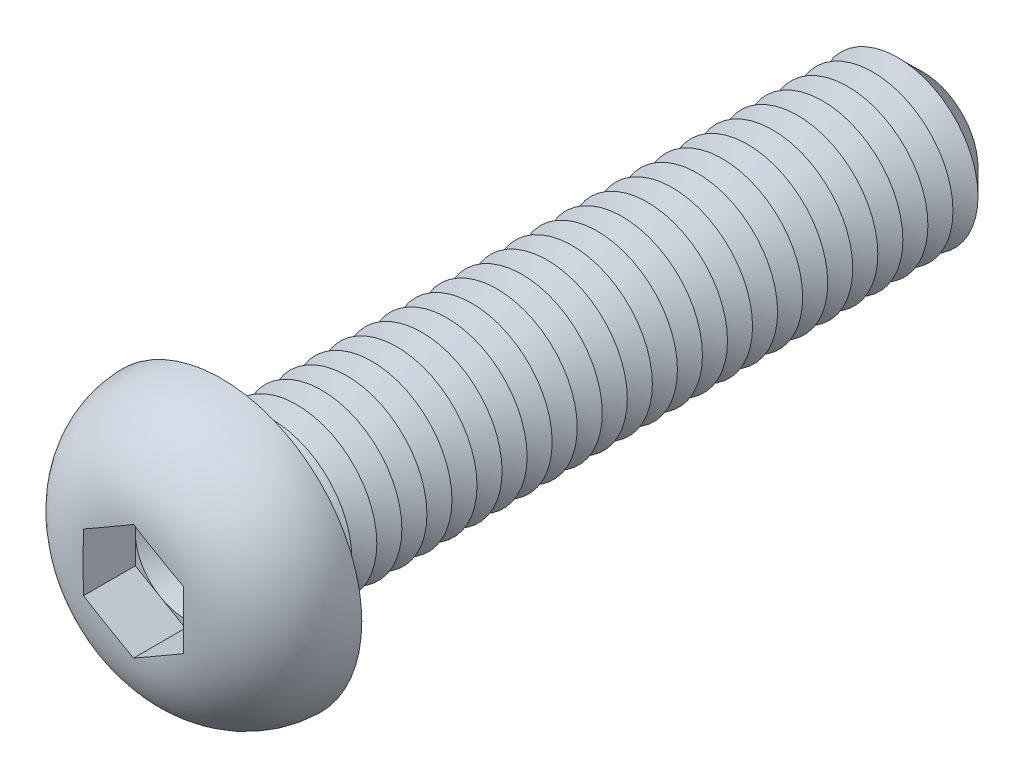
ISO-10303-21;
HEADER;
FILE_DESCRIPTION(('STEP AP214'),'2;1');
FILE_NAME('part.step','',(''),(''),'','','');
FILE_SCHEMA(('AUTOMOTIVE_DESIGN { 1 0 10303 214 1 1 1 1 }'));
ENDSEC;
DATA;
#1=APPLICATION_CONTEXT('core data for automotive mechanical design processes');
#2=APPLICATION_PROTOCOL_DEFINITION('international standard','automotive_design',2000,#1);
#3=PRODUCT_CONTEXT('',#1,'mechanical');
#4=PRODUCT('Part','Part','',(#3));
#5=PRODUCT_RELATED_PRODUCT_CATEGORY('part','',(#4));
#6=PRODUCT_DEFINITION_FORMATION('','',#4);
#7=PRODUCT_DEFINITION_CONTEXT('part definition',#1,'design');
#8=PRODUCT_DEFINITION('design','',#6,#7);
#9=PRODUCT_DEFINITION_SHAPE('','',#8);
#10=(LENGTH_UNIT() NAMED_UNIT(*) SI_UNIT(.MILLI.,.METRE.));
#11=(NAMED_UNIT(*) PLANE_ANGLE_UNIT() SI_UNIT($,.RADIAN.));
#12=(NAMED_UNIT(*) SI_UNIT($,.STERADIAN.) SOLID_ANGLE_UNIT());
#13=UNCERTAINTY_MEASURE_WITH_UNIT(LENGTH_MEASURE(1.E-05),#10,'distance_accuracy_value','');
#14=(GEOMETRIC_REPRESENTATION_CONTEXT(3) GLOBAL_UNCERTAINTY_ASSIGNED_CONTEXT((#13)) GLOBAL_UNIT_ASSIGNED_CONTEXT((#10,
#11,#12)) REPRESENTATION_CONTEXT('',''));
#15=CARTESIAN_POINT('',(0.,0.,0.));
#16=DIRECTION('',(0.,0.,1.));
#17=DIRECTION('',(1.,0.,0.));
#18=AXIS2_PLACEMENT_3D('',#15,#16,#17);
#19=CARTESIAN_POINT('',(0.,0.,1.8));
#20=DIRECTION('',(0.,0.,1.));
#21=DIRECTION('',(1.,0.,0.));
#22=AXIS2_PLACEMENT_3D('',#19,#20,#21);
#23=PLANE('',#22);
#24=CARTESIAN_POINT('',(0.,0.,1.8));
#25=DIRECTION('',(0.,0.,1.));
#26=DIRECTION('',(1.,0.,0.));
#27=AXIS2_PLACEMENT_3D('',#24,#25,#26);
#28=CIRCLE('',#27,2.5);
#29=CARTESIAN_POINT('',(2.5,0.,1.8));
#30=VERTEX_POINT('',#29);
#31=CARTESIAN_POINT('',(1.25,2.1650635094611,1.8));
#32=VERTEX_POINT('',#31);
#33=EDGE_CURVE('E153',#30,#32,#28,.T.);
#34=ORIENTED_EDGE('',*,*,#33,.F.);
#35=DIRECTION('',(0.,1.,0.));
#36=VECTOR('',#35,1.);
#37=CARTESIAN_POINT('',(2.5,-1.44337567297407,1.8));
#38=LINE('',#37,#36);
#39=CARTESIAN_POINT('',(2.5,1.44337567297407,1.8));
#40=VERTEX_POINT('',#39);
#41=EDGE_CURVE('E176',#30,#40,#38,.T.);
#42=ORIENTED_EDGE('',*,*,#41,.T.);
#43=DIRECTION('',(-0.866025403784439,0.5,0.));
#44=VECTOR('',#43,1.);
#45=CARTESIAN_POINT('',(2.5,1.44337567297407,1.8));
#46=LINE('',#45,#44);
#47=EDGE_CURVE('E172',#40,#32,#46,.T.);
#48=ORIENTED_EDGE('',*,*,#47,.T.);
#49=EDGE_LOOP('',(#34,#42,#48));
#50=FACE_BOUND('',#49,.T.);
#51=ADVANCED_FACE('F39',(#50),#23,.T.);
#52=CARTESIAN_POINT('',(0.,0.,1.8));
#53=DIRECTION('',(0.,0.,1.));
#54=DIRECTION('',(1.,0.,0.));
#55=AXIS2_PLACEMENT_3D('',#52,#53,#54);
#56=CIRCLE('',#55,2.5);
#57=CARTESIAN_POINT('',(-1.25,2.1650635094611,1.8));
#58=VERTEX_POINT('',#57);
#59=EDGE_CURVE('E11',#32,#58,#56,.T.);
#60=ORIENTED_EDGE('',*,*,#59,.F.);
#61=CARTESIAN_POINT('',(0.,2.88675134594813,1.8));
#62=VERTEX_POINT('',#61);
#63=EDGE_CURVE('E166',#32,#62,#46,.T.);
#64=ORIENTED_EDGE('',*,*,#63,.T.);
#65=DIRECTION('',(-0.866025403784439,-0.5,0.));
#66=VECTOR('',#65,1.);
#67=CARTESIAN_POINT('',(0.,2.88675134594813,1.8));
#68=LINE('',#67,#66);
#69=EDGE_CURVE('E167',#62,#58,#68,.T.);
#70=ORIENTED_EDGE('',*,*,#69,.T.);
#71=EDGE_LOOP('',(#60,#64,#70));
#72=FACE_BOUND('',#71,.T.);
#73=ADVANCED_FACE('F165',(#72),#23,.T.);
#74=CARTESIAN_POINT('',(-2.5,0.,1.8));
#75=VERTEX_POINT('',#74);
#76=EDGE_CURVE('E49',#58,#75,#56,.T.);
#77=ORIENTED_EDGE('',*,*,#76,.F.);
#78=CARTESIAN_POINT('',(-2.5,1.44337567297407,1.8));
#79=VERTEX_POINT('',#78);
#80=EDGE_CURVE('E179',#58,#79,#68,.T.);
#81=ORIENTED_EDGE('',*,*,#80,.T.);
#82=DIRECTION('',(0.,-1.,0.));
#83=VECTOR('',#82,1.);
#84=CARTESIAN_POINT('',(-2.5,1.44337567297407,1.8));
#85=LINE('',#84,#83);
#86=EDGE_CURVE('E190',#79,#75,#85,.T.);
#87=ORIENTED_EDGE('',*,*,#86,.T.);
#88=EDGE_LOOP('',(#77,#81,#87));
#89=FACE_BOUND('',#88,.T.);
#90=ADVANCED_FACE('F441',(#89),#23,.T.);
#91=CARTESIAN_POINT('',(-1.25,-2.1650635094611,1.8));
#92=VERTEX_POINT('',#91);
#93=EDGE_CURVE('E423',#75,#92,#56,.T.);
#94=ORIENTED_EDGE('',*,*,#93,.F.);
#95=CARTESIAN_POINT('',(-2.5,-1.44337567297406,1.8));
#96=VERTEX_POINT('',#95);
#97=EDGE_CURVE('E189',#75,#96,#85,.T.);
#98=ORIENTED_EDGE('',*,*,#97,.T.);
#99=DIRECTION('',(0.866025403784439,-0.5,0.));
#100=VECTOR('',#99,1.);
#101=CARTESIAN_POINT('',(-2.5,-1.44337567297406,1.8));
#102=LINE('',#101,#100);
#103=EDGE_CURVE('E194',#96,#92,#102,.T.);
#104=ORIENTED_EDGE('',*,*,#103,.T.);
#105=EDGE_LOOP('',(#94,#98,#104));
#106=FACE_BOUND('',#105,.T.);
#107=ADVANCED_FACE('F435',(#106),#23,.T.);
#108=CARTESIAN_POINT('',(1.25,-2.1650635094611,1.8));
#109=VERTEX_POINT('',#108);
#110=EDGE_CURVE('E56',#92,#109,#56,.T.);
#111=ORIENTED_EDGE('',*,*,#110,.F.);
#112=CARTESIAN_POINT('',(0.,-2.88675134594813,1.8));
#113=VERTEX_POINT('',#112);
#114=EDGE_CURVE('E193',#92,#113,#102,.T.);
#115=ORIENTED_EDGE('',*,*,#114,.T.);
#116=DIRECTION('',(0.866025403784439,0.5,0.));
#117=VECTOR('',#116,1.);
#118=CARTESIAN_POINT('',(0.,-2.88675134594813,1.8));
#119=LINE('',#118,#117);
#120=EDGE_CURVE('E199',#113,#109,#119,.T.);
#121=ORIENTED_EDGE('',*,*,#120,.T.);
#122=EDGE_LOOP('',(#111,#115,#121));
#123=FACE_BOUND('',#122,.T.);
#124=ADVANCED_FACE('F474',(#123),#23,.T.);
#125=CARTESIAN_POINT('',(0.,0.,-35.));
#126=DIRECTION('',(0.,0.,1.));
#127=DIRECTION('',(1.,0.,0.));
#128=AXIS2_PLACEMENT_3D('',#125,#126,#127);
#129=CYLINDRICAL_SURFACE('',#128,4.);
#130=CARTESIAN_POINT('',(0.,0.,-0.5));
#131=DIRECTION('',(0.,0.,1.));
#132=DIRECTION('',(1.,0.,0.));
#133=AXIS2_PLACEMENT_3D('',#130,#131,#132);
#134=CIRCLE('',#133,4.);
#135=CARTESIAN_POINT('',(4.,0.,-0.5));
#136=VERTEX_POINT('',#135);
#137=EDGE_CURVE('E410',#136,#136,#134,.F.);
#138=ORIENTED_EDGE('',*,*,#137,.T.);
#139=EDGE_LOOP('',(#138));
#140=FACE_BOUND('',#139,.T.);
#141=CARTESIAN_POINT('',(0.,0.,-1.25));
#142=DIRECTION('',(0.,0.,1.));
#143=DIRECTION('',(1.,0.,0.));
#144=AXIS2_PLACEMENT_3D('',#141,#142,#143);
#145=CIRCLE('',#144,4.00000000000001);
#146=CARTESIAN_POINT('',(4.00000000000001,0.,-1.25));
#147=VERTEX_POINT('',#146);
#148=EDGE_CURVE('E185',#147,#147,#145,.T.);
#149=ORIENTED_EDGE('',*,*,#148,.T.);
#150=EDGE_LOOP('',(#149));
#151=FACE_BOUND('',#150,.T.);
#152=ADVANCED_FACE('F469',(#140,#151),#129,.T.);
#153=CARTESIAN_POINT('',(0.,7.,0.));
#154=DIRECTION('',(0.,0.,1.));
#155=DIRECTION('',(1.,0.,0.));
#156=AXIS2_PLACEMENT_3D('',#153,#154,#155);
#157=PLANE('',#156);
#158=CARTESIAN_POINT('',(0.,0.,0.));
#159=DIRECTION('',(0.,0.,1.));
#160=DIRECTION('',(1.,0.,0.));
#161=AXIS2_PLACEMENT_3D('',#158,#159,#160);
#162=CIRCLE('',#161,4.5);
#163=CARTESIAN_POINT('',(4.5,0.,0.));
#164=VERTEX_POINT('',#163);
#165=EDGE_CURVE('E413',#164,#164,#162,.T.);
#166=ORIENTED_EDGE('',*,*,#165,.T.);
#167=EDGE_LOOP('',(#166));
#168=FACE_BOUND('',#167,.T.);
#169=CARTESIAN_POINT('',(0.,0.,0.));
#170=DIRECTION('',(0.,0.,1.));
#171=DIRECTION('',(1.,0.,0.));
#172=AXIS2_PLACEMENT_3D('',#169,#170,#171);
#173=CIRCLE('',#172,7.);
#174=CARTESIAN_POINT('',(7.,0.,0.));
#175=VERTEX_POINT('',#174);
#176=EDGE_CURVE('E210',#175,#175,#173,.T.);
#177=ORIENTED_EDGE('',*,*,#176,.F.);
#178=EDGE_LOOP('',(#177));
#179=FACE_BOUND('',#178,.T.);
#180=ADVANCED_FACE('F467',(#168,#179),#157,.F.);
#181=CARTESIAN_POINT('',(0.,0.,-0.1));
#182=DIRECTION('',(0.,0.,1.));
#183=DIRECTION('',(1.,0.,0.));
#184=AXIS2_PLACEMENT_3D('',#181,#182,#183);
#185=DEGENERATE_TOROIDAL_SURFACE('',#184,2.5011112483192,4.5,.T.);
#186=CARTESIAN_POINT('',(1.31456088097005,2.12778926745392,4.4));
#187=DIRECTION('',(-0.866025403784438,0.500000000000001,0.));
#188=VECTOR('',#187,1.);
#189=LINE('',#186,#188);
#190=CARTESIAN_POINT('',(1.31456088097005,2.12778926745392,4.4));
#191=VERTEX_POINT('',#190);
#192=CARTESIAN_POINT('',(1.18543911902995,2.20233775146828,4.4));
#193=VERTEX_POINT('',#192);
#194=EDGE_CURVE('E398',#191,#193,#189,.T.);
#195=ORIENTED_EDGE('',*,*,#194,.F.);
#196=CARTESIAN_POINT('',(-0.000200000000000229,2.88686681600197,4.38343536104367));
#197=CARTESIAN_POINT('',(0.103935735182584,2.82674402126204,4.38859262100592));
#198=CARTESIAN_POINT('',(0.208111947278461,2.76659785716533,4.39207570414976));
#199=CARTESIAN_POINT('',(0.416486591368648,2.64629270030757,4.39683754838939));
#200=CARTESIAN_POINT('',(0.520685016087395,2.58613371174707,4.39811670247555));
#201=CARTESIAN_POINT('',(0.729066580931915,2.46582455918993,4.3996156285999));
#202=CARTESIAN_POINT('',(0.833249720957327,2.40567439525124,4.39983556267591));
#203=CARTESIAN_POINT('',(1.04162190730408,2.2853706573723,4.4000276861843));
#204=CARTESIAN_POINT('',(1.14581095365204,2.2252170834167,4.39999986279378));
#205=CARTESIAN_POINT('',(1.35418904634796,2.10490993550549,4.39999986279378));
#206=CARTESIAN_POINT('',(1.45837809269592,2.04475636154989,4.4000276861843));
#207=CARTESIAN_POINT('',(1.66675027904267,1.92445262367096,4.39983556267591));
#208=CARTESIAN_POINT('',(1.77093341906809,1.86430245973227,4.3996156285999));
#209=CARTESIAN_POINT('',(1.97931498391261,1.74399330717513,4.39811670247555));
#210=CARTESIAN_POINT('',(2.08351340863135,1.68383431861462,4.39683754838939));
#211=CARTESIAN_POINT('',(2.29188805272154,1.56352916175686,4.39207570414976));
#212=CARTESIAN_POINT('',(2.39606426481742,1.50338299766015,4.38859262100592));
#213=CARTESIAN_POINT('',(2.5002,1.44326020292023,4.38343536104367));
#214=B_SPLINE_CURVE_WITH_KNOTS('',3,(#196,#197,#198,#199,#200,#201,#202,#203,#204,#205,#206,
#207,#208,#209,#210,#211,#212,#213),.UNSPECIFIED.,.F.,.F.,(4,2,2,2,2,2,2,2,4),(0.,
0.361022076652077,0.721979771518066,1.08288224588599,1.44380339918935,1.80472455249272,
2.16562702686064,2.52658472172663,2.88760679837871),.UNSPECIFIED.);
#215=CARTESIAN_POINT('',(2.5,1.44337567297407,4.38344529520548));
#216=VERTEX_POINT('',#215);
#217=EDGE_CURVE('E354',#191,#216,#214,.T.);
#218=ORIENTED_EDGE('',*,*,#217,.T.);
#219=CARTESIAN_POINT('',(2.5,0.,4.39999986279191));
#220=CARTESIAN_POINT('',(2.5,-0.104697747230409,4.39999811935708));
#221=CARTESIAN_POINT('',(2.5,-0.209395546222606,4.40001551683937));
#222=CARTESIAN_POINT('',(2.5,-0.418792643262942,4.39990807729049));
#223=CARTESIAN_POINT('',(2.5,-0.52349194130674,4.39978323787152));
#224=CARTESIAN_POINT('',(2.5,-0.732936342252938,4.39891238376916));
#225=CARTESIAN_POINT('',(2.5,-0.837681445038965,4.39816609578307));
#226=CARTESIAN_POINT('',(2.5,-1.04715282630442,4.39536239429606));
#227=CARTESIAN_POINT('',(2.5,-1.15187910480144,4.39330498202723));
#228=CARTESIAN_POINT('',(2.5,-1.46476484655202,4.38400647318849));
#229=CARTESIAN_POINT('',(2.5,-1.67286375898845,4.37365196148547));
#230=CARTESIAN_POINT('',(2.5,-2.08783281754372,4.33852954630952));
#231=CARTESIAN_POINT('',(2.5,-2.29470379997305,4.31377296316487));
#232=CARTESIAN_POINT('',(2.5,-2.64451002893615,4.25536510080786));
#233=CARTESIAN_POINT('',(2.5,-2.78823975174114,4.22651785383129));
#234=CARTESIAN_POINT('',(2.5,-3.073224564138,4.15827060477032));
#235=CARTESIAN_POINT('',(2.5,-3.21447933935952,4.11886927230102));
#236=CARTESIAN_POINT('',(2.5,-3.49353952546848,4.02870287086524));
#237=CARTESIAN_POINT('',(2.5,-3.6313402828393,3.97792330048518));
#238=CARTESIAN_POINT('',(2.5,-3.90204977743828,3.86463774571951));
#239=CARTESIAN_POINT('',(2.5,-4.0349587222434,3.8021322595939));
#240=CARTESIAN_POINT('',(2.5,-4.2956525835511,3.66474880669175));
#241=CARTESIAN_POINT('',(2.5,-4.42338586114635,3.58977252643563));
#242=CARTESIAN_POINT('',(2.5,-4.67118559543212,3.42803136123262));
#243=CARTESIAN_POINT('',(2.5,-4.79125159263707,3.3412657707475));
#244=CARTESIAN_POINT('',(2.5,-5.02233156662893,3.15645800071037));
#245=CARTESIAN_POINT('',(2.5,-5.13334771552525,3.05841854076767));
#246=CARTESIAN_POINT('',(2.5,-5.34506083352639,2.85177471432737));
#247=CARTESIAN_POINT('',(2.5,-5.44575933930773,2.74317192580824));
#248=CARTESIAN_POINT('',(2.5,-5.62335564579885,2.53102225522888));
#249=CARTESIAN_POINT('',(2.5,-5.70164721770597,2.42863868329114));
#250=CARTESIAN_POINT('',(2.5,-5.84882394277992,2.21725758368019));
#251=CARTESIAN_POINT('',(2.5,-5.91770588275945,2.10825781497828));
#252=CARTESIAN_POINT('',(2.5,-6.04532926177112,1.88460009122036));
#253=CARTESIAN_POINT('',(2.5,-6.1040794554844,1.76994713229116));
#254=CARTESIAN_POINT('',(2.5,-6.21098181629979,1.53574793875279));
#255=CARTESIAN_POINT('',(2.5,-6.25913021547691,1.41619998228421));
#256=CARTESIAN_POINT('',(2.5,-6.34173830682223,1.18065209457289));
#257=CARTESIAN_POINT('',(2.5,-6.37685491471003,1.06488207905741));
#258=CARTESIAN_POINT('',(2.5,-6.43703913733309,0.830714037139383));
#259=CARTESIAN_POINT('',(2.5,-6.46210319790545,0.712315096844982));
#260=CARTESIAN_POINT('',(2.5,-6.50194044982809,0.473848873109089));
#261=CARTESIAN_POINT('',(2.5,-6.51671856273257,0.353782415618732));
#262=CARTESIAN_POINT('',(2.5,-6.53588982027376,0.112808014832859));
#263=CARTESIAN_POINT('',(2.5,-6.54027911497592,-0.00810022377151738));
#264=CARTESIAN_POINT('',(2.5,-6.53779027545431,-0.365870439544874));
#265=CARTESIAN_POINT('',(2.5,-6.51607942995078,-0.602790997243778));
#266=CARTESIAN_POINT('',(2.5,-6.43310265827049,-1.06957107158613));
#267=CARTESIAN_POINT('',(2.5,-6.3718398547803,-1.29943114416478));
#268=CARTESIAN_POINT('',(2.5,-6.25195024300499,-1.63390601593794));
#269=CARTESIAN_POINT('',(2.5,-6.20730237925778,-1.74371189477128));
#270=CARTESIAN_POINT('',(2.5,-6.10902350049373,-1.95921136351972));
#271=CARTESIAN_POINT('',(2.5,-6.05539567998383,-2.06490639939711));
#272=CARTESIAN_POINT('',(2.5,-5.93955620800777,-2.27152527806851));
#273=CARTESIAN_POINT('',(2.5,-5.87734126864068,-2.37244727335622));
#274=CARTESIAN_POINT('',(2.5,-5.7448545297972,-2.56880727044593));
#275=CARTESIAN_POINT('',(2.5,-5.67458537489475,-2.6642470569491));
#276=CARTESIAN_POINT('',(2.5,-5.52523018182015,-2.85070592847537));
#277=CARTESIAN_POINT('',(2.5,-5.44601185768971,-2.94161901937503));
#278=CARTESIAN_POINT('',(2.5,-5.28044044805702,-3.11663859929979));
#279=CARTESIAN_POINT('',(2.5,-5.194089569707,-3.2007471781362));
#280=CARTESIAN_POINT('',(2.5,-5.01485870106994,-3.36178408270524));
#281=CARTESIAN_POINT('',(2.5,-4.92197538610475,-3.43870870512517));
#282=CARTESIAN_POINT('',(2.5,-4.73045535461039,-3.58495812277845));
#283=CARTESIAN_POINT('',(2.5,-4.6318202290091,-3.65428500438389));
#284=CARTESIAN_POINT('',(2.5,-4.4247626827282,-3.78818551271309));
#285=CARTESIAN_POINT('',(2.5,-4.31609824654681,-3.85238474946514));
#286=CARTESIAN_POINT('',(2.5,-4.0940582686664,-3.97208975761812));
#287=CARTESIAN_POINT('',(2.5,-3.98068153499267,-4.02759331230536));
#288=CARTESIAN_POINT('',(2.5,-3.75029026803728,-4.12981004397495));
#289=CARTESIAN_POINT('',(2.5,-3.63328275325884,-4.17653908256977));
#290=CARTESIAN_POINT('',(2.5,-3.39631992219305,-4.2614893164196));
#291=CARTESIAN_POINT('',(2.5,-3.27636651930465,-4.29971587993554));
#292=CARTESIAN_POINT('',(2.5,-3.00446622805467,-4.37644925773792));
#293=CARTESIAN_POINT('',(2.5,-2.85188931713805,-4.41272455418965));
#294=CARTESIAN_POINT('',(2.5,-2.54443794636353,-4.47385449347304));
#295=CARTESIAN_POINT('',(2.5,-2.3895624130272,-4.49870361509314));
#296=CARTESIAN_POINT('',(2.5,-2.07807451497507,-4.53870829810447));
#297=CARTESIAN_POINT('',(2.5,-1.92145805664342,-4.55383091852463));
#298=CARTESIAN_POINT('',(2.5,-1.60772330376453,-4.57647936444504));
#299=CARTESIAN_POINT('',(2.5,-1.45060502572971,-4.58400543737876));
#300=CARTESIAN_POINT('',(2.5,-1.13432460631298,-4.59416656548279));
#301=CARTESIAN_POINT('',(2.5,-0.975160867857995,-4.59674096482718));
#302=CARTESIAN_POINT('',(2.5,-0.656826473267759,-4.59957813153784));
#303=CARTESIAN_POINT('',(2.5,-0.497655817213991,-4.59984092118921));
#304=CARTESIAN_POINT('',(2.5,-0.179547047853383,-4.60005428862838));
#305=CARTESIAN_POINT('',(2.5,-0.02060893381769,-4.60000532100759));
#306=CARTESIAN_POINT('',(2.5,0.297265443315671,-4.59999304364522));
#307=CARTESIAN_POINT('',(2.5,0.456201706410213,-4.60002973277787));
#308=CARTESIAN_POINT('',(2.5,0.70967559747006,-4.59902611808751));
#309=CARTESIAN_POINT('',(2.5,0.804213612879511,-4.59841616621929));
#310=CARTESIAN_POINT('',(2.5,0.99327694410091,-4.59620676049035));
#311=CARTESIAN_POINT('',(2.5,1.08780225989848,-4.59460730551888));
#312=CARTESIAN_POINT('',(2.5,1.37137837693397,-4.58746770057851));
#313=CARTESIAN_POINT('',(2.5,1.56039301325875,-4.57958602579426));
#314=CARTESIAN_POINT('',(2.5,1.93609462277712,-4.55305686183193));
#315=CARTESIAN_POINT('',(2.5,2.12278756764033,-4.53450331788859));
#316=CARTESIAN_POINT('',(2.5,2.49421016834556,-4.48296248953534));
#317=CARTESIAN_POINT('',(2.5,2.67894050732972,-4.44998040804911));
#318=CARTESIAN_POINT('',(2.5,2.99962701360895,-4.37718406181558));
#319=CARTESIAN_POINT('',(2.5,3.13641465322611,-4.34103978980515));
#320=CARTESIAN_POINT('',(2.5,3.40682838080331,-4.25834226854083));
#321=CARTESIAN_POINT('',(2.5,3.54045461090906,-4.21178948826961));
#322=CARTESIAN_POINT('',(2.5,3.80387940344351,-4.1076796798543));
#323=CARTESIAN_POINT('',(2.5,3.93366385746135,-4.05008679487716));
#324=CARTESIAN_POINT('',(2.5,4.18776789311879,-3.92385886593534));
#325=CARTESIAN_POINT('',(2.5,4.31208736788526,-3.85522360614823));
#326=CARTESIAN_POINT('',(2.5,4.55475418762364,-3.70660227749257));
#327=CARTESIAN_POINT('',(2.5,4.67306276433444,-3.62655275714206));
#328=CARTESIAN_POINT('',(2.5,4.90171316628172,-3.45576294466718));
#329=CARTESIAN_POINT('',(2.5,5.01205476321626,-3.36502234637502));
#330=CARTESIAN_POINT('',(2.5,5.22347091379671,-3.17353376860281));
#331=CARTESIAN_POINT('',(2.5,5.32455555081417,-3.07279693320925));
#332=CARTESIAN_POINT('',(2.5,5.51647993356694,-2.86200023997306));
#333=CARTESIAN_POINT('',(2.5,5.6073208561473,-2.75194145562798));
#334=CARTESIAN_POINT('',(2.5,5.76832451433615,-2.53607083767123));
#335=CARTESIAN_POINT('',(2.5,5.83966300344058,-2.4311337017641));
#336=CARTESIAN_POINT('',(2.5,5.97282702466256,-2.2153291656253));
#337=CARTESIAN_POINT('',(2.5,6.03464926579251,-2.10445973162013));
#338=CARTESIAN_POINT('',(2.5,6.14815657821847,-1.87771731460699));
#339=CARTESIAN_POINT('',(2.5,6.19984675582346,-1.76184688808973));
#340=CARTESIAN_POINT('',(2.5,6.29267395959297,-1.52590109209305));
#341=CARTESIAN_POINT('',(2.5,6.33380720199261,-1.40582423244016));
#342=CARTESIAN_POINT('',(2.5,6.40328888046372,-1.16869740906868));
#343=CARTESIAN_POINT('',(2.5,6.43218419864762,-1.05180738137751));
#344=CARTESIAN_POINT('',(2.5,6.47988151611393,-0.815941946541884));
#345=CARTESIAN_POINT('',(2.5,6.49867991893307,-0.696965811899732));
#346=CARTESIAN_POINT('',(2.5,6.52599950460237,-0.457898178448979));
#347=CARTESIAN_POINT('',(2.5,6.53452634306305,-0.337807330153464));
#348=CARTESIAN_POINT('',(2.5,6.54126106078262,-0.0973214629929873));
#349=CARTESIAN_POINT('',(2.5,6.5394651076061,0.023073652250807));
#350=CARTESIAN_POINT('',(2.5,6.51879545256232,0.379398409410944));
#351=CARTESIAN_POINT('',(2.5,6.48510560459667,0.614630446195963));
#352=CARTESIAN_POINT('',(2.5,6.37872360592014,1.07608887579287));
#353=CARTESIAN_POINT('',(2.5,6.30603128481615,1.3023152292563));
#354=CARTESIAN_POINT('',(2.5,6.16957161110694,1.63028303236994));
#355=CARTESIAN_POINT('',(2.5,6.11941470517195,1.7378698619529));
#356=CARTESIAN_POINT('',(2.5,6.01034124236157,1.94849153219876));
#357=CARTESIAN_POINT('',(2.5,5.9514277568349,2.05152795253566));
#358=CARTESIAN_POINT('',(2.5,5.82528890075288,2.25240256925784));
#359=CARTESIAN_POINT('',(2.5,5.75806159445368,2.35023954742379));
#360=CARTESIAN_POINT('',(2.5,5.61585543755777,2.54005689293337));
#361=CARTESIAN_POINT('',(2.5,5.54087908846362,2.63203913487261));
#362=CARTESIAN_POINT('',(2.5,5.38212190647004,2.81146438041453));
#363=CARTESIAN_POINT('',(2.5,5.29819182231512,2.89877528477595));
#364=CARTESIAN_POINT('',(2.5,5.12353712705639,3.06625194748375));
#365=CARTESIAN_POINT('',(2.5,5.03281455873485,3.14641983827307));
#366=CARTESIAN_POINT('',(2.5,4.84518171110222,3.29930665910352));
#367=CARTESIAN_POINT('',(2.5,4.74826657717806,3.37201962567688));
#368=CARTESIAN_POINT('',(2.5,4.54907485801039,3.50961479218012));
#369=CARTESIAN_POINT('',(2.5,4.44679969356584,3.57449905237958));
#370=CARTESIAN_POINT('',(2.5,4.23202545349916,3.69953578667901));
#371=CARTESIAN_POINT('',(2.5,4.11927203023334,3.75925114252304));
#372=CARTESIAN_POINT('',(2.5,3.88947986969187,3.86977617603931));
#373=CARTESIAN_POINT('',(2.5,3.77244067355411,3.92058489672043));
#374=CARTESIAN_POINT('',(2.5,3.5351804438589,4.0133148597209));
#375=CARTESIAN_POINT('',(2.5,3.41496637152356,4.0552539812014));
#376=CARTESIAN_POINT('',(2.5,3.17195278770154,4.13067246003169));
#377=CARTESIAN_POINT('',(2.5,3.04915378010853,4.16415344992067));
#378=CARTESIAN_POINT('',(2.5,2.80683027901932,4.22194717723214));
#379=CARTESIAN_POINT('',(2.5,2.68738216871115,4.2465834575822));
#380=CARTESIAN_POINT('',(2.5,2.44729214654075,4.28920746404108));
#381=CARTESIAN_POINT('',(2.5,2.32664997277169,4.30719369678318));
#382=CARTESIAN_POINT('',(2.5,2.08450864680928,4.33736171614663));
#383=CARTESIAN_POINT('',(2.5,1.9630086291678,4.3495363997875));
#384=CARTESIAN_POINT('',(2.5,1.71961501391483,4.36908103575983));
#385=CARTESIAN_POINT('',(2.5,1.59772134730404,4.37645009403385));
#386=CARTESIAN_POINT('',(2.5,1.35283283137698,4.38761579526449));
#387=CARTESIAN_POINT('',(2.5,1.22983679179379,4.39138420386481));
#388=CARTESIAN_POINT('',(2.5,0.983808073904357,4.3965493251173));
#389=CARTESIAN_POINT('',(2.5,0.860775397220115,4.3979461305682));
#390=CARTESIAN_POINT('',(2.5,0.614783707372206,4.39958107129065));
#391=CARTESIAN_POINT('',(2.5,0.491824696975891,4.3998199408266));
#392=CARTESIAN_POINT('',(2.5,0.245910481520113,4.40003035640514));
#393=CARTESIAN_POINT('',(2.5,0.122955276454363,4.4000019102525));
#394=CARTESIAN_POINT('',(2.5,0.,4.39999986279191));
#395=B_SPLINE_CURVE_WITH_KNOTS('',3,(#219,#220,#221,#222,#223,#224,#225,#226,#227,#228,#229,
#230,#231,#232,#233,#234,#235,#236,#237,#238,#239,#240,#241,#242,#243,#244,#245,#246,#247,#248,
#249,#250,#251,#252,#253,#254,#255,#256,#257,#258,#259,#260,#261,#262,#263,#264,#265,#266,#267,
#268,#269,#270,#271,#272,#273,#274,#275,#276,#277,#278,#279,#280,#281,#282,#283,#284,#285,#286,
#287,#288,#289,#290,#291,#292,#293,#294,#295,#296,#297,#298,#299,#300,#301,#302,#303,#304,#305,
#306,#307,#308,#309,#310,#311,#312,#313,#314,#315,#316,#317,#318,#319,#320,#321,#322,#323,#324,
#325,#326,#327,#328,#329,#330,#331,#332,#333,#334,#335,#336,#337,#338,#339,#340,#341,#342,#343,
#344,#345,#346,#347,#348,#349,#350,#351,#352,#353,#354,#355,#356,#357,#358,#359,#360,#361,#362,
#363,#364,#365,#366,#367,#368,#369,#370,#371,#372,#373,#374,#375,#376,#377,#378,#379,#380,#381,
#382,#383,#384,#385,#386,#387,#388,#389,#390,#391,#392,#393,#394),.UNSPECIFIED.,.T.,.F.,(4,2,2,
2,2,2,2,2,2,2,2,2,2,2,2,2,2,2,2,2,2,2,2,2,2,2,2,2,2,2,2,2,2,2,2,2,2,2,2,2,2,2,2,2,2,2,2,2,2,2,2,
2,2,2,2,2,2,2,2,2,2,2,2,2,2,2,2,2,2,2,2,2,2,2,2,2,2,2,2,2,2,2,2,2,2,2,2,4),(0.,
0.314093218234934,0.62819170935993,0.942428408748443,1.25666481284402,1.88144147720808,
2.50572771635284,2.94516878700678,3.38466527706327,3.82472511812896,4.26476626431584,
4.70845695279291,5.15217420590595,5.59578464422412,6.03932891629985,6.42549664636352,
6.81179591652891,7.19775970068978,7.58386043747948,7.94635637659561,8.30898036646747,
8.67143073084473,9.03401539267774,9.74414367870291,10.4542159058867,10.8094792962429,
11.1646165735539,11.5198902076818,11.8750475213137,12.2363927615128,12.597626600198,
12.9590456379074,13.3203651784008,13.698597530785,14.0769261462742,14.4545641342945,
14.8319630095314,15.3019396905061,15.7721432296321,16.2439309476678,16.715703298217,
17.1932187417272,17.6707295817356,18.1475442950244,18.6243527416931,18.9079682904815,
19.1915841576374,19.7589248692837,20.3213460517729,20.8835645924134,21.3076400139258,
21.731696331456,22.1571540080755,22.5826200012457,23.0105507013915,23.4384936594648,
23.8659647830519,24.2933867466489,24.6735755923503,25.0538956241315,25.4340234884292,
25.8142874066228,26.1750761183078,26.5359932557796,26.8967115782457,27.2575638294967,
27.9668653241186,28.6761699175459,29.0319382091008,29.3875820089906,29.7433087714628,
30.0989210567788,30.4618400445,30.8246503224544,31.1877485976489,31.5507511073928,
31.9331198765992,32.3155297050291,32.6971611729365,33.0787189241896,33.4443988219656,
33.8101607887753,34.1763686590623,34.54264464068,34.9117697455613,35.2808804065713,
35.6497569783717,36.0186227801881),.UNSPECIFIED.);
#396=CARTESIAN_POINT('',(2.5,0.0745484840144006,4.4));
#397=VERTEX_POINT('',#396);
#398=EDGE_CURVE('E344',#216,#397,#395,.T.);
#399=ORIENTED_EDGE('',*,*,#398,.T.);
#400=CARTESIAN_POINT('',(2.5,-0.0745484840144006,4.4));
#401=DIRECTION('',(0.,1.,0.));
#402=VECTOR('',#401,1.);
#403=LINE('',#400,#402);
#404=CARTESIAN_POINT('',(2.5,-0.0745484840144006,4.4));
#405=VERTEX_POINT('',#404);
#406=EDGE_CURVE('E174',#405,#397,#403,.T.);
#407=ORIENTED_EDGE('',*,*,#406,.F.);
#408=CARTESIAN_POINT('',(2.5,-1.44337567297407,4.38344529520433));
#409=VERTEX_POINT('',#408);
#410=EDGE_CURVE('E355',#405,#409,#395,.T.);
#411=ORIENTED_EDGE('',*,*,#410,.T.);
#412=CARTESIAN_POINT('',(2.5002,-1.44326020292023,4.38343536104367));
#413=CARTESIAN_POINT('',(2.39606426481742,-1.50338299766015,4.38859262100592));
#414=CARTESIAN_POINT('',(2.29188805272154,-1.56352916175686,4.39207570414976));
#415=CARTESIAN_POINT('',(2.08351340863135,-1.68383431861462,4.39683754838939));
#416=CARTESIAN_POINT('',(1.9793149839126,-1.74399330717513,4.39811670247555));
#417=CARTESIAN_POINT('',(1.77093341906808,-1.86430245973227,4.3996156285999));
#418=CARTESIAN_POINT('',(1.66675027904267,-1.92445262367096,4.39983556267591));
#419=CARTESIAN_POINT('',(1.45837809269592,-2.04475636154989,4.4000276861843));
#420=CARTESIAN_POINT('',(1.35418904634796,-2.10490993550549,4.39999986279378));
#421=CARTESIAN_POINT('',(1.14581095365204,-2.2252170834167,4.39999986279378));
#422=CARTESIAN_POINT('',(1.04162190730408,-2.2853706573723,4.4000276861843));
#423=CARTESIAN_POINT('',(0.833249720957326,-2.40567439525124,4.39983556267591));
#424=CARTESIAN_POINT('',(0.729066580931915,-2.46582455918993,4.3996156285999));
#425=CARTESIAN_POINT('',(0.520685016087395,-2.58613371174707,4.39811670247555));
#426=CARTESIAN_POINT('',(0.416486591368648,-2.64629270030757,4.39683754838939));
#427=CARTESIAN_POINT('',(0.208111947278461,-2.76659785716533,4.39207570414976));
#428=CARTESIAN_POINT('',(0.103935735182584,-2.82674402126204,4.38859262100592));
#429=CARTESIAN_POINT('',(-0.000200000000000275,-2.88686681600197,4.38343536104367));
#430=B_SPLINE_CURVE_WITH_KNOTS('',3,(#412,#413,#414,#415,#416,#417,#418,#419,#420,#421,#422,
#423,#424,#425,#426,#427,#428,#429),.UNSPECIFIED.,.F.,.F.,(4,2,2,2,2,2,2,2,4),(0.,
0.361022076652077,0.721979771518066,1.08288224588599,1.44380339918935,1.80472455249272,
2.16562702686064,2.52658472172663,2.88760679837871),.UNSPECIFIED.);
#431=CARTESIAN_POINT('',(1.31456088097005,-2.12778926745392,4.4));
#432=VERTEX_POINT('',#431);
#433=EDGE_CURVE('E331',#409,#432,#430,.T.);
#434=ORIENTED_EDGE('',*,*,#433,.T.);
#435=CARTESIAN_POINT('',(1.18543911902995,-2.20233775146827,4.4));
#436=DIRECTION('',(0.866025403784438,0.500000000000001,0.));
#437=VECTOR('',#436,1.);
#438=LINE('',#435,#437);
#439=CARTESIAN_POINT('',(1.18543911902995,-2.20233775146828,4.4));
#440=VERTEX_POINT('',#439);
#441=EDGE_CURVE('E340',#440,#432,#438,.T.);
#442=ORIENTED_EDGE('',*,*,#441,.F.);
#443=CARTESIAN_POINT('',(0.,-2.88675134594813,4.38344529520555));
#444=VERTEX_POINT('',#443);
#445=EDGE_CURVE('E294',#440,#444,#430,.T.);
#446=ORIENTED_EDGE('',*,*,#445,.T.);
#447=CARTESIAN_POINT('',(0.00019999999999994,-2.88686681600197,4.38343536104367));
#448=CARTESIAN_POINT('',(-0.103935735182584,-2.82674402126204,4.38859262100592));
#449=CARTESIAN_POINT('',(-0.208111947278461,-2.76659785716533,4.39207570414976));
#450=CARTESIAN_POINT('',(-0.416486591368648,-2.64629270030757,4.39683754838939));
#451=CARTESIAN_POINT('',(-0.520685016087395,-2.58613371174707,4.39811670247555));
#452=CARTESIAN_POINT('',(-0.729066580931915,-2.46582455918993,4.3996156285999));
#453=CARTESIAN_POINT('',(-0.833249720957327,-2.40567439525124,4.39983556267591));
#454=CARTESIAN_POINT('',(-1.04162190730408,-2.2853706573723,4.4000276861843));
#455=CARTESIAN_POINT('',(-1.14581095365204,-2.2252170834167,4.39999986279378));
#456=CARTESIAN_POINT('',(-1.35418904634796,-2.10490993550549,4.39999986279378));
#457=CARTESIAN_POINT('',(-1.45837809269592,-2.04475636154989,4.4000276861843));
#458=CARTESIAN_POINT('',(-1.66675027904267,-1.92445262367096,4.39983556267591));
#459=CARTESIAN_POINT('',(-1.77093341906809,-1.86430245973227,4.3996156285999));
#460=CARTESIAN_POINT('',(-1.97931498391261,-1.74399330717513,4.39811670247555));
#461=CARTESIAN_POINT('',(-2.08351340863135,-1.68383431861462,4.39683754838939));
#462=CARTESIAN_POINT('',(-2.29188805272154,-1.56352916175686,4.39207570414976));
#463=CARTESIAN_POINT('',(-2.39606426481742,-1.50338299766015,4.38859262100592));
#464=CARTESIAN_POINT('',(-2.5002,-1.44326020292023,4.38343536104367));
#465=B_SPLINE_CURVE_WITH_KNOTS('',3,(#447,#448,#449,#450,#451,#452,#453,#454,#455,#456,#457,
#458,#459,#460,#461,#462,#463,#464),.UNSPECIFIED.,.F.,.F.,(4,2,2,2,2,2,2,2,4),(0.,
0.361022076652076,0.721979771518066,1.08288224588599,1.44380339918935,1.80472455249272,
2.16562702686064,2.52658472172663,2.88760679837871),.UNSPECIFIED.);
#466=CARTESIAN_POINT('',(-1.18543911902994,-2.20233775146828,4.4));
#467=VERTEX_POINT('',#466);
#468=EDGE_CURVE('E284',#444,#467,#465,.T.);
#469=ORIENTED_EDGE('',*,*,#468,.T.);
#470=CARTESIAN_POINT('',(-1.31456088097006,-2.12778926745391,4.4));
#471=DIRECTION('',(0.86602540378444,-0.499999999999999,0.));
#472=VECTOR('',#471,1.);
#473=LINE('',#470,#472);
#474=CARTESIAN_POINT('',(-1.31456088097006,-2.12778926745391,4.4));
#475=VERTEX_POINT('',#474);
#476=EDGE_CURVE('E569',#475,#467,#473,.T.);
#477=ORIENTED_EDGE('',*,*,#476,.F.);
#478=CARTESIAN_POINT('',(-2.5,-1.44337567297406,4.38344529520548));
#479=VERTEX_POINT('',#478);
#480=EDGE_CURVE('E295',#475,#479,#465,.T.);
#481=ORIENTED_EDGE('',*,*,#480,.T.);
#482=CARTESIAN_POINT('',(-2.5,0.,4.39999986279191));
#483=CARTESIAN_POINT('',(-2.5,0.104697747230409,4.39999811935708));
#484=CARTESIAN_POINT('',(-2.5,0.209395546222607,4.40001551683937));
#485=CARTESIAN_POINT('',(-2.5,0.418792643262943,4.39990807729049));
#486=CARTESIAN_POINT('',(-2.5,0.523491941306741,4.39978323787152));
#487=CARTESIAN_POINT('',(-2.5,0.732936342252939,4.39891238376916));
#488=CARTESIAN_POINT('',(-2.5,0.837681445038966,4.39816609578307));
#489=CARTESIAN_POINT('',(-2.5,1.04715282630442,4.39536239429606));
#490=CARTESIAN_POINT('',(-2.5,1.15187910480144,4.39330498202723));
#491=CARTESIAN_POINT('',(-2.5,1.46476484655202,4.38400647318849));
#492=CARTESIAN_POINT('',(-2.5,1.67286375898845,4.37365196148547));
#493=CARTESIAN_POINT('',(-2.5,2.08783281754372,4.33852954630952));
#494=CARTESIAN_POINT('',(-2.5,2.29470379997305,4.31377296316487));
#495=CARTESIAN_POINT('',(-2.5,2.64451002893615,4.25536510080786));
#496=CARTESIAN_POINT('',(-2.5,2.78823975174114,4.22651785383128));
#497=CARTESIAN_POINT('',(-2.5,3.073224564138,4.15827060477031));
#498=CARTESIAN_POINT('',(-2.5,3.21447933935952,4.11886927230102));
#499=CARTESIAN_POINT('',(-2.5,3.49353952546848,4.02870287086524));
#500=CARTESIAN_POINT('',(-2.5,3.6313402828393,3.97792330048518));
#501=CARTESIAN_POINT('',(-2.5,3.90204977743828,3.8646377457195));
#502=CARTESIAN_POINT('',(-2.5,4.0349587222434,3.8021322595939));
#503=CARTESIAN_POINT('',(-2.5,4.2956525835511,3.66474880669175));
#504=CARTESIAN_POINT('',(-2.5,4.42338586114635,3.58977252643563));
#505=CARTESIAN_POINT('',(-2.5,4.67118559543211,3.42803136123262));
#506=CARTESIAN_POINT('',(-2.5,4.79125159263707,3.3412657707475));
#507=CARTESIAN_POINT('',(-2.5,5.02233156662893,3.15645800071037));
#508=CARTESIAN_POINT('',(-2.5,5.13334771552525,3.05841854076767));
#509=CARTESIAN_POINT('',(-2.5,5.34506083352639,2.85177471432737));
#510=CARTESIAN_POINT('',(-2.5,5.44575933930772,2.74317192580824));
#511=CARTESIAN_POINT('',(-2.5,5.62335564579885,2.53102225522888));
#512=CARTESIAN_POINT('',(-2.5,5.70164721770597,2.42863868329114));
#513=CARTESIAN_POINT('',(-2.5,5.84882394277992,2.21725758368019));
#514=CARTESIAN_POINT('',(-2.5,5.91770588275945,2.10825781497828));
#515=CARTESIAN_POINT('',(-2.5,6.04532926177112,1.88460009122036));
#516=CARTESIAN_POINT('',(-2.5,6.1040794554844,1.76994713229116));
#517=CARTESIAN_POINT('',(-2.5,6.21098181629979,1.53574793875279));
#518=CARTESIAN_POINT('',(-2.5,6.25913021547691,1.41619998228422));
#519=CARTESIAN_POINT('',(-2.5,6.34173830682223,1.18065209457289));
#520=CARTESIAN_POINT('',(-2.5,6.37685491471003,1.06488207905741));
#521=CARTESIAN_POINT('',(-2.5,6.43703913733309,0.830714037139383));
#522=CARTESIAN_POINT('',(-2.5,6.46210319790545,0.712315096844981));
#523=CARTESIAN_POINT('',(-2.5,6.50194044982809,0.473848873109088));
#524=CARTESIAN_POINT('',(-2.5,6.51671856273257,0.35378241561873));
#525=CARTESIAN_POINT('',(-2.5,6.53588982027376,0.112808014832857));
#526=CARTESIAN_POINT('',(-2.5,6.54027911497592,-0.00810022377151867));
#527=CARTESIAN_POINT('',(-2.5,6.53779027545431,-0.365870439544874));
#528=CARTESIAN_POINT('',(-2.5,6.51607942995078,-0.602790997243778));
#529=CARTESIAN_POINT('',(-2.5,6.43310265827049,-1.06957107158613));
#530=CARTESIAN_POINT('',(-2.5,6.3718398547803,-1.29943114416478));
#531=CARTESIAN_POINT('',(-2.5,6.25195024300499,-1.63390601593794));
#532=CARTESIAN_POINT('',(-2.5,6.20730237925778,-1.74371189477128));
#533=CARTESIAN_POINT('',(-2.5,6.10902350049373,-1.95921136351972));
#534=CARTESIAN_POINT('',(-2.5,6.05539567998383,-2.06490639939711));
#535=CARTESIAN_POINT('',(-2.5,5.93955620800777,-2.27152527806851));
#536=CARTESIAN_POINT('',(-2.5,5.87734126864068,-2.37244727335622));
#537=CARTESIAN_POINT('',(-2.5,5.7448545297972,-2.56880727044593));
#538=CARTESIAN_POINT('',(-2.5,5.67458537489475,-2.6642470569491));
#539=CARTESIAN_POINT('',(-2.5,5.52523018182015,-2.85070592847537));
#540=CARTESIAN_POINT('',(-2.5,5.44601185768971,-2.94161901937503));
#541=CARTESIAN_POINT('',(-2.5,5.28044044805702,-3.11663859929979));
#542=CARTESIAN_POINT('',(-2.5,5.194089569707,-3.2007471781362));
#543=CARTESIAN_POINT('',(-2.5,5.01485870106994,-3.36178408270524));
#544=CARTESIAN_POINT('',(-2.5,4.92197538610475,-3.43870870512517));
#545=CARTESIAN_POINT('',(-2.5,4.73045535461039,-3.58495812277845));
#546=CARTESIAN_POINT('',(-2.5,4.6318202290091,-3.65428500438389));
#547=CARTESIAN_POINT('',(-2.5,4.4247626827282,-3.78818551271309));
#548=CARTESIAN_POINT('',(-2.5,4.31609824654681,-3.85238474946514));
#549=CARTESIAN_POINT('',(-2.5,4.0940582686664,-3.97208975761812));
#550=CARTESIAN_POINT('',(-2.5,3.98068153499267,-4.02759331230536));
#551=CARTESIAN_POINT('',(-2.5,3.75029026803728,-4.12981004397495));
#552=CARTESIAN_POINT('',(-2.5,3.63328275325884,-4.17653908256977));
#553=CARTESIAN_POINT('',(-2.5,3.39631992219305,-4.2614893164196));
#554=CARTESIAN_POINT('',(-2.5,3.27636651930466,-4.29971587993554));
#555=CARTESIAN_POINT('',(-2.5,3.00446622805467,-4.37644925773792));
#556=CARTESIAN_POINT('',(-2.5,2.85188931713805,-4.41272455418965));
#557=CARTESIAN_POINT('',(-2.5,2.54443794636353,-4.47385449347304));
#558=CARTESIAN_POINT('',(-2.5,2.3895624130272,-4.49870361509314));
#559=CARTESIAN_POINT('',(-2.5,2.07807451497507,-4.53870829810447));
#560=CARTESIAN_POINT('',(-2.5,1.92145805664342,-4.55383091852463));
#561=CARTESIAN_POINT('',(-2.5,1.60772330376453,-4.57647936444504));
#562=CARTESIAN_POINT('',(-2.5,1.45060502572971,-4.58400543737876));
#563=CARTESIAN_POINT('',(-2.5,1.13432460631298,-4.59416656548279));
#564=CARTESIAN_POINT('',(-2.5,0.975160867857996,-4.59674096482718));
#565=CARTESIAN_POINT('',(-2.5,0.65682647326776,-4.59957813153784));
#566=CARTESIAN_POINT('',(-2.5,0.497655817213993,-4.59984092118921));
#567=CARTESIAN_POINT('',(-2.5,0.179547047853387,-4.60005428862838));
#568=CARTESIAN_POINT('',(-2.5,0.0206089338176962,-4.60000532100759));
#569=CARTESIAN_POINT('',(-2.5,-0.297265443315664,-4.59999304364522));
#570=CARTESIAN_POINT('',(-2.5,-0.456201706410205,-4.60002973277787));
#571=CARTESIAN_POINT('',(-2.5,-0.709675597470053,-4.59902611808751));
#572=CARTESIAN_POINT('',(-2.5,-0.804213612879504,-4.59841616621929));
#573=CARTESIAN_POINT('',(-2.5,-0.993276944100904,-4.59620676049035));
#574=CARTESIAN_POINT('',(-2.5,-1.08780225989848,-4.59460730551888));
#575=CARTESIAN_POINT('',(-2.5,-1.37137837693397,-4.58746770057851));
#576=CARTESIAN_POINT('',(-2.5,-1.56039301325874,-4.57958602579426));
#577=CARTESIAN_POINT('',(-2.5,-1.93609462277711,-4.55305686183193));
#578=CARTESIAN_POINT('',(-2.5,-2.12278756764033,-4.53450331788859));
#579=CARTESIAN_POINT('',(-2.5,-2.49421016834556,-4.48296248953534));
#580=CARTESIAN_POINT('',(-2.5,-2.67894050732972,-4.44998040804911));
#581=CARTESIAN_POINT('',(-2.5,-2.99962701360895,-4.37718406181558));
#582=CARTESIAN_POINT('',(-2.5,-3.13641465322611,-4.34103978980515));
#583=CARTESIAN_POINT('',(-2.5,-3.40682838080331,-4.25834226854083));
#584=CARTESIAN_POINT('',(-2.5,-3.54045461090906,-4.21178948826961));
#585=CARTESIAN_POINT('',(-2.5,-3.8038794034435,-4.1076796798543));
#586=CARTESIAN_POINT('',(-2.5,-3.93366385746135,-4.05008679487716));
#587=CARTESIAN_POINT('',(-2.5,-4.18776789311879,-3.92385886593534));
#588=CARTESIAN_POINT('',(-2.5,-4.31208736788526,-3.85522360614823));
#589=CARTESIAN_POINT('',(-2.5,-4.55475418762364,-3.70660227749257));
#590=CARTESIAN_POINT('',(-2.5,-4.67306276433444,-3.62655275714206));
#591=CARTESIAN_POINT('',(-2.5,-4.90171316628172,-3.45576294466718));
#592=CARTESIAN_POINT('',(-2.5,-5.01205476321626,-3.36502234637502));
#593=CARTESIAN_POINT('',(-2.5,-5.2234709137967,-3.17353376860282));
#594=CARTESIAN_POINT('',(-2.5,-5.32455555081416,-3.07279693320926));
#595=CARTESIAN_POINT('',(-2.5,-5.51647993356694,-2.86200023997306));
#596=CARTESIAN_POINT('',(-2.5,-5.6073208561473,-2.75194145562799));
#597=CARTESIAN_POINT('',(-2.5,-5.76832451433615,-2.53607083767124));
#598=CARTESIAN_POINT('',(-2.5,-5.83966300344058,-2.4311337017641));
#599=CARTESIAN_POINT('',(-2.5,-5.97282702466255,-2.2153291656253));
#600=CARTESIAN_POINT('',(-2.5,-6.03464926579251,-2.10445973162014));
#601=CARTESIAN_POINT('',(-2.5,-6.14815657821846,-1.877717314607));
#602=CARTESIAN_POINT('',(-2.5,-6.19984675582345,-1.76184688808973));
#603=CARTESIAN_POINT('',(-2.5,-6.29267395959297,-1.52590109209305));
#604=CARTESIAN_POINT('',(-2.5,-6.33380720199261,-1.40582423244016));
#605=CARTESIAN_POINT('',(-2.5,-6.40328888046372,-1.16869740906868));
#606=CARTESIAN_POINT('',(-2.5,-6.43218419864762,-1.05180738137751));
#607=CARTESIAN_POINT('',(-2.5,-6.47988151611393,-0.815941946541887));
#608=CARTESIAN_POINT('',(-2.5,-6.49867991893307,-0.696965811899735));
#609=CARTESIAN_POINT('',(-2.5,-6.52599950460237,-0.457898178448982));
#610=CARTESIAN_POINT('',(-2.5,-6.53452634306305,-0.337807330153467));
#611=CARTESIAN_POINT('',(-2.5,-6.54126106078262,-0.09732146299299));
#612=CARTESIAN_POINT('',(-2.5,-6.5394651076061,0.0230736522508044));
#613=CARTESIAN_POINT('',(-2.5,-6.51879545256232,0.379398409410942));
#614=CARTESIAN_POINT('',(-2.5,-6.48510560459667,0.614630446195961));
#615=CARTESIAN_POINT('',(-2.5,-6.37872360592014,1.07608887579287));
#616=CARTESIAN_POINT('',(-2.5,-6.30603128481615,1.3023152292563));
#617=CARTESIAN_POINT('',(-2.5,-6.16957161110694,1.63028303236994));
#618=CARTESIAN_POINT('',(-2.5,-6.11941470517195,1.7378698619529));
#619=CARTESIAN_POINT('',(-2.5,-6.01034124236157,1.94849153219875));
#620=CARTESIAN_POINT('',(-2.5,-5.9514277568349,2.05152795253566));
#621=CARTESIAN_POINT('',(-2.5,-5.82528890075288,2.25240256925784));
#622=CARTESIAN_POINT('',(-2.5,-5.75806159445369,2.35023954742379));
#623=CARTESIAN_POINT('',(-2.5,-5.61585543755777,2.54005689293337));
#624=CARTESIAN_POINT('',(-2.5,-5.54087908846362,2.63203913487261));
#625=CARTESIAN_POINT('',(-2.5,-5.38212190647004,2.81146438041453));
#626=CARTESIAN_POINT('',(-2.5,-5.29819182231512,2.89877528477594));
#627=CARTESIAN_POINT('',(-2.5,-5.1235371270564,3.06625194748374));
#628=CARTESIAN_POINT('',(-2.5,-5.03281455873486,3.14641983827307));
#629=CARTESIAN_POINT('',(-2.5,-4.84518171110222,3.29930665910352));
#630=CARTESIAN_POINT('',(-2.5,-4.74826657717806,3.37201962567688));
#631=CARTESIAN_POINT('',(-2.5,-4.54907485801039,3.50961479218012));
#632=CARTESIAN_POINT('',(-2.5,-4.44679969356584,3.57449905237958));
#633=CARTESIAN_POINT('',(-2.5,-4.23202545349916,3.69953578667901));
#634=CARTESIAN_POINT('',(-2.5,-4.11927203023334,3.75925114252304));
#635=CARTESIAN_POINT('',(-2.5,-3.88947986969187,3.86977617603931));
#636=CARTESIAN_POINT('',(-2.5,-3.77244067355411,3.92058489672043));
#637=CARTESIAN_POINT('',(-2.5,-3.5351804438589,4.0133148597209));
#638=CARTESIAN_POINT('',(-2.5,-3.41496637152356,4.0552539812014));
#639=CARTESIAN_POINT('',(-2.5,-3.17195278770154,4.13067246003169));
#640=CARTESIAN_POINT('',(-2.5,-3.04915378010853,4.16415344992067));
#641=CARTESIAN_POINT('',(-2.5,-2.80683027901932,4.22194717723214));
#642=CARTESIAN_POINT('',(-2.5,-2.68738216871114,4.2465834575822));
#643=CARTESIAN_POINT('',(-2.5,-2.44729214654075,4.28920746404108));
#644=CARTESIAN_POINT('',(-2.5,-2.32664997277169,4.30719369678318));
#645=CARTESIAN_POINT('',(-2.5,-2.08450864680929,4.33736171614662));
#646=CARTESIAN_POINT('',(-2.5,-1.96300862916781,4.34953639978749));
#647=CARTESIAN_POINT('',(-2.5,-1.71961501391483,4.36908103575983));
#648=CARTESIAN_POINT('',(-2.5,-1.59772134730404,4.37645009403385));
#649=CARTESIAN_POINT('',(-2.5,-1.35283283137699,4.38761579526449));
#650=CARTESIAN_POINT('',(-2.5,-1.2298367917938,4.39138420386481));
#651=CARTESIAN_POINT('',(-2.5,-0.983808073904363,4.3965493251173));
#652=CARTESIAN_POINT('',(-2.5,-0.860775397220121,4.3979461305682));
#653=CARTESIAN_POINT('',(-2.5,-0.61478370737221,4.39958107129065));
#654=CARTESIAN_POINT('',(-2.5,-0.491824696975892,4.3998199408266));
#655=CARTESIAN_POINT('',(-2.5,-0.245910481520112,4.40003035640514));
#656=CARTESIAN_POINT('',(-2.5,-0.122955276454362,4.4000019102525));
#657=CARTESIAN_POINT('',(-2.5,0.,4.39999986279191));
#658=B_SPLINE_CURVE_WITH_KNOTS('',3,(#482,#483,#484,#485,#486,#487,#488,#489,#490,#491,#492,
#493,#494,#495,#496,#497,#498,#499,#500,#501,#502,#503,#504,#505,#506,#507,#508,#509,#510,#511,
#512,#513,#514,#515,#516,#517,#518,#519,#520,#521,#522,#523,#524,#525,#526,#527,#528,#529,#530,
#531,#532,#533,#534,#535,#536,#537,#538,#539,#540,#541,#542,#543,#544,#545,#546,#547,#548,#549,
#550,#551,#552,#553,#554,#555,#556,#557,#558,#559,#560,#561,#562,#563,#564,#565,#566,#567,#568,
#569,#570,#571,#572,#573,#574,#575,#576,#577,#578,#579,#580,#581,#582,#583,#584,#585,#586,#587,
#588,#589,#590,#591,#592,#593,#594,#595,#596,#597,#598,#599,#600,#601,#602,#603,#604,#605,#606,
#607,#608,#609,#610,#611,#612,#613,#614,#615,#616,#617,#618,#619,#620,#621,#622,#623,#624,#625,
#626,#627,#628,#629,#630,#631,#632,#633,#634,#635,#636,#637,#638,#639,#640,#641,#642,#643,#644,
#645,#646,#647,#648,#649,#650,#651,#652,#653,#654,#655,#656,#657),.UNSPECIFIED.,.T.,.F.,(4,2,2,
2,2,2,2,2,2,2,2,2,2,2,2,2,2,2,2,2,2,2,2,2,2,2,2,2,2,2,2,2,2,2,2,2,2,2,2,2,2,2,2,2,2,2,2,2,2,2,2,
2,2,2,2,2,2,2,2,2,2,2,2,2,2,2,2,2,2,2,2,2,2,2,2,2,2,2,2,2,2,2,2,2,2,2,2,4),(0.,
0.314093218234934,0.62819170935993,0.942428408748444,1.25666481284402,1.88144147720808,
2.50572771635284,2.94516878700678,3.38466527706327,3.82472511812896,4.26476626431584,
4.70845695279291,5.15217420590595,5.59578464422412,6.03932891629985,6.42549664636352,
6.8117959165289,7.19775970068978,7.58386043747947,7.94635637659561,8.30898036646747,
8.67143073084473,9.03401539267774,9.74414367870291,10.4542159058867,10.8094792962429,
11.1646165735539,11.5198902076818,11.8750475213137,12.2363927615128,12.597626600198,
12.9590456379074,13.3203651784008,13.698597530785,14.0769261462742,14.4545641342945,
14.8319630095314,15.3019396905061,15.7721432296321,16.2439309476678,16.715703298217,
17.1932187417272,17.6707295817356,18.1475442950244,18.6243527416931,18.9079682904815,
19.1915841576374,19.7589248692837,20.3213460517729,20.8835645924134,21.3076400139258,
21.731696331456,22.1571540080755,22.5826200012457,23.0105507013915,23.4384936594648,
23.8659647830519,24.2933867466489,24.6735755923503,25.0538956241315,25.4340234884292,
25.8142874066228,26.1750761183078,26.5359932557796,26.8967115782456,27.2575638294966,
27.9668653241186,28.6761699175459,29.0319382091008,29.3875820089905,29.7433087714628,
30.0989210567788,30.4618400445,30.8246503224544,31.1877485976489,31.5507511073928,
31.9331198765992,32.3155297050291,32.6971611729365,33.0787189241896,33.4443988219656,
33.8101607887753,34.1763686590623,34.5426446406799,34.9117697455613,35.2808804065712,
35.6497569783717,36.0186227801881),.UNSPECIFIED.);
#659=CARTESIAN_POINT('',(-2.5,-0.0745484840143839,4.4));
#660=VERTEX_POINT('',#659);
#661=EDGE_CURVE('E268',#479,#660,#658,.T.);
#662=ORIENTED_EDGE('',*,*,#661,.T.);
#663=CARTESIAN_POINT('',(-2.5,0.0745484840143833,4.4));
#664=DIRECTION('',(0.,-1.,0.));
#665=VECTOR('',#664,1.);
#666=LINE('',#663,#665);
#667=CARTESIAN_POINT('',(-2.5,0.0745484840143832,4.4));
#668=VERTEX_POINT('',#667);
#669=EDGE_CURVE('E280',#668,#660,#666,.T.);
#670=ORIENTED_EDGE('',*,*,#669,.F.);
#671=CARTESIAN_POINT('',(-2.5,1.44337567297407,4.38344529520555));
#672=VERTEX_POINT('',#671);
#673=EDGE_CURVE('E271',#668,#672,#658,.T.);
#674=ORIENTED_EDGE('',*,*,#673,.T.);
#675=CARTESIAN_POINT('',(-2.5002,1.44326020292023,4.38343536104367));
#676=CARTESIAN_POINT('',(-2.39606426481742,1.50338299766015,4.38859262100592));
#677=CARTESIAN_POINT('',(-2.29188805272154,1.56352916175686,4.39207570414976));
#678=CARTESIAN_POINT('',(-2.08351340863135,1.68383431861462,4.39683754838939));
#679=CARTESIAN_POINT('',(-1.97931498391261,1.74399330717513,4.39811670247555));
#680=CARTESIAN_POINT('',(-1.77093341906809,1.86430245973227,4.3996156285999));
#681=CARTESIAN_POINT('',(-1.66675027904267,1.92445262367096,4.39983556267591));
#682=CARTESIAN_POINT('',(-1.45837809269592,2.04475636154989,4.4000276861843));
#683=CARTESIAN_POINT('',(-1.35418904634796,2.10490993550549,4.39999986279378));
#684=CARTESIAN_POINT('',(-1.14581095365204,2.2252170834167,4.39999986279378));
#685=CARTESIAN_POINT('',(-1.04162190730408,2.2853706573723,4.4000276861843));
#686=CARTESIAN_POINT('',(-0.833249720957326,2.40567439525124,4.39983556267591));
#687=CARTESIAN_POINT('',(-0.729066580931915,2.46582455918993,4.3996156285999));
#688=CARTESIAN_POINT('',(-0.520685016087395,2.58613371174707,4.39811670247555));
#689=CARTESIAN_POINT('',(-0.416486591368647,2.64629270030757,4.39683754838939));
#690=CARTESIAN_POINT('',(-0.208111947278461,2.76659785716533,4.39207570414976));
#691=CARTESIAN_POINT('',(-0.103935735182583,2.82674402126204,4.38859262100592));
#692=CARTESIAN_POINT('',(0.000200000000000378,2.88686681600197,4.38343536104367));
#693=B_SPLINE_CURVE_WITH_KNOTS('',3,(#675,#676,#677,#678,#679,#680,#681,#682,#683,#684,#685,
#686,#687,#688,#689,#690,#691,#692),.UNSPECIFIED.,.F.,.F.,(4,2,2,2,2,2,2,2,4),(0.,
0.361022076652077,0.721979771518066,1.08288224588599,1.44380339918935,1.80472455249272,
2.16562702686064,2.52658472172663,2.88760679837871),.UNSPECIFIED.);
#694=CARTESIAN_POINT('',(-1.31456088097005,2.12778926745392,4.4));
#695=VERTEX_POINT('',#694);
#696=EDGE_CURVE('E275',#672,#695,#693,.T.);
#697=ORIENTED_EDGE('',*,*,#696,.T.);
#698=CARTESIAN_POINT('',(-1.18543911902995,2.20233775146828,4.4));
#699=DIRECTION('',(-0.866025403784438,-0.500000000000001,0.));
#700=VECTOR('',#699,1.);
#701=LINE('',#698,#700);
#702=CARTESIAN_POINT('',(-1.18543911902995,2.20233775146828,4.4));
#703=VERTEX_POINT('',#702);
#704=EDGE_CURVE('E447',#703,#695,#701,.T.);
#705=ORIENTED_EDGE('',*,*,#704,.F.);
#706=CARTESIAN_POINT('',(0.,2.88675134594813,4.38344529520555));
#707=VERTEX_POINT('',#706);
#708=EDGE_CURVE('E452',#703,#707,#693,.T.);
#709=ORIENTED_EDGE('',*,*,#708,.T.);
#710=EDGE_CURVE('E388',#707,#193,#214,.T.);
#711=ORIENTED_EDGE('',*,*,#710,.T.);
#712=EDGE_LOOP('',(#195,#218,#399,#407,#411,#434,#442,#446,#469,#477,#481,#662,#670,#674,#697,
#705,#709,#711));
#713=FACE_BOUND('',#712,.T.);
#714=ORIENTED_EDGE('',*,*,#176,.T.);
#715=EDGE_LOOP('',(#714));
#716=FACE_BOUND('',#715,.T.);
#717=ADVANCED_FACE('F239',(#713,#716),#185,.T.);
#718=CARTESIAN_POINT('',(2.5,1.44337567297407,1.8));
#719=DIRECTION('',(0.5,0.866025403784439,0.));
#720=DIRECTION('',(-0.866025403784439,0.5,0.));
#721=AXIS2_PLACEMENT_3D('',#718,#719,#720);
#722=PLANE('',#721);
#723=DIRECTION('',(0.,0.,1.));
#724=VECTOR('',#723,1.);
#725=CARTESIAN_POINT('',(0.,2.88675134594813,1.8));
#726=LINE('',#725,#724);
#727=EDGE_CURVE('E64',#62,#707,#726,.T.);
#728=ORIENTED_EDGE('',*,*,#727,.F.);
#729=ORIENTED_EDGE('',*,*,#63,.F.);
#730=ORIENTED_EDGE('',*,*,#47,.F.);
#731=DIRECTION('',(0.,0.,1.));
#732=VECTOR('',#731,1.);
#733=CARTESIAN_POINT('',(2.5,1.44337567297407,1.8));
#734=LINE('',#733,#732);
#735=EDGE_CURVE('E207',#40,#216,#734,.T.);
#736=ORIENTED_EDGE('',*,*,#735,.T.);
#737=ORIENTED_EDGE('',*,*,#217,.F.);
#738=ORIENTED_EDGE('',*,*,#194,.T.);
#739=ORIENTED_EDGE('',*,*,#710,.F.);
#740=EDGE_LOOP('',(#728,#729,#730,#736,#737,#738,#739));
#741=FACE_BOUND('',#740,.T.);
#742=ADVANCED_FACE('F170',(#741),#722,.F.);
#743=CARTESIAN_POINT('',(2.5,-1.44337567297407,1.8));
#744=DIRECTION('',(1.,0.,0.));
#745=DIRECTION('',(0.,0.,-1.));
#746=AXIS2_PLACEMENT_3D('',#743,#744,#745);
#747=PLANE('',#746);
#748=ORIENTED_EDGE('',*,*,#406,.T.);
#749=ORIENTED_EDGE('',*,*,#398,.F.);
#750=ORIENTED_EDGE('',*,*,#735,.F.);
#751=ORIENTED_EDGE('',*,*,#41,.F.);
#752=CARTESIAN_POINT('',(2.5,-1.44337567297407,1.8));
#753=VERTEX_POINT('',#752);
#754=EDGE_CURVE('E203',#753,#30,#38,.T.);
#755=ORIENTED_EDGE('',*,*,#754,.F.);
#756=DIRECTION('',(0.,0.,1.));
#757=VECTOR('',#756,1.);
#758=CARTESIAN_POINT('',(2.5,-1.44337567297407,1.8));
#759=LINE('',#758,#757);
#760=EDGE_CURVE('E211',#753,#409,#759,.T.);
#761=ORIENTED_EDGE('',*,*,#760,.T.);
#762=ORIENTED_EDGE('',*,*,#410,.F.);
#763=EDGE_LOOP('',(#748,#749,#750,#751,#755,#761,#762));
#764=FACE_BOUND('',#763,.T.);
#765=ADVANCED_FACE('F365',(#764),#747,.F.);
#766=CARTESIAN_POINT('',(0.,-2.88675134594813,1.8));
#767=DIRECTION('',(0.5,-0.866025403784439,0.));
#768=DIRECTION('',(0.866025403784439,0.5,0.));
#769=AXIS2_PLACEMENT_3D('',#766,#767,#768);
#770=PLANE('',#769);
#771=ORIENTED_EDGE('',*,*,#760,.F.);
#772=EDGE_CURVE('E198',#109,#753,#119,.T.);
#773=ORIENTED_EDGE('',*,*,#772,.F.);
#774=ORIENTED_EDGE('',*,*,#120,.F.);
#775=DIRECTION('',(0.,0.,1.));
#776=VECTOR('',#775,1.);
#777=CARTESIAN_POINT('',(0.,-2.88675134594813,1.8));
#778=LINE('',#777,#776);
#779=EDGE_CURVE('E215',#113,#444,#778,.T.);
#780=ORIENTED_EDGE('',*,*,#779,.T.);
#781=ORIENTED_EDGE('',*,*,#445,.F.);
#782=ORIENTED_EDGE('',*,*,#441,.T.);
#783=ORIENTED_EDGE('',*,*,#433,.F.);
#784=EDGE_LOOP('',(#771,#773,#774,#780,#781,#782,#783));
#785=FACE_BOUND('',#784,.T.);
#786=ADVANCED_FACE('F310',(#785),#770,.F.);
#787=CARTESIAN_POINT('',(-2.5,-1.44337567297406,1.8));
#788=DIRECTION('',(-0.5,-0.866025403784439,0.));
#789=DIRECTION('',(0.866025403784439,-0.5,0.));
#790=AXIS2_PLACEMENT_3D('',#787,#788,#789);
#791=PLANE('',#790);
#792=ORIENTED_EDGE('',*,*,#779,.F.);
#793=ORIENTED_EDGE('',*,*,#114,.F.);
#794=ORIENTED_EDGE('',*,*,#103,.F.);
#795=DIRECTION('',(0.,0.,1.));
#796=VECTOR('',#795,1.);
#797=CARTESIAN_POINT('',(-2.5,-1.44337567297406,1.8));
#798=LINE('',#797,#796);
#799=EDGE_CURVE('E219',#96,#479,#798,.T.);
#800=ORIENTED_EDGE('',*,*,#799,.T.);
#801=ORIENTED_EDGE('',*,*,#480,.F.);
#802=ORIENTED_EDGE('',*,*,#476,.T.);
#803=ORIENTED_EDGE('',*,*,#468,.F.);
#804=EDGE_LOOP('',(#792,#793,#794,#800,#801,#802,#803));
#805=FACE_BOUND('',#804,.T.);
#806=ADVANCED_FACE('F306',(#805),#791,.F.);
#807=CARTESIAN_POINT('',(-2.5,1.44337567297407,1.8));
#808=DIRECTION('',(-1.,0.,0.));
#809=DIRECTION('',(0.,-1.,0.));
#810=AXIS2_PLACEMENT_3D('',#807,#808,#809);
#811=PLANE('',#810);
#812=ORIENTED_EDGE('',*,*,#669,.T.);
#813=ORIENTED_EDGE('',*,*,#661,.F.);
#814=ORIENTED_EDGE('',*,*,#799,.F.);
#815=ORIENTED_EDGE('',*,*,#97,.F.);
#816=ORIENTED_EDGE('',*,*,#86,.F.);
#817=DIRECTION('',(0.,0.,1.));
#818=VECTOR('',#817,1.);
#819=CARTESIAN_POINT('',(-2.5,1.44337567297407,1.8));
#820=LINE('',#819,#818);
#821=EDGE_CURVE('E223',#79,#672,#820,.T.);
#822=ORIENTED_EDGE('',*,*,#821,.T.);
#823=ORIENTED_EDGE('',*,*,#673,.F.);
#824=EDGE_LOOP('',(#812,#813,#814,#815,#816,#822,#823));
#825=FACE_BOUND('',#824,.T.);
#826=ADVANCED_FACE('F248',(#825),#811,.F.);
#827=CARTESIAN_POINT('',(0.,2.88675134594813,1.8));
#828=DIRECTION('',(-0.5,0.866025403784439,0.));
#829=DIRECTION('',(-0.866025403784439,-0.5,0.));
#830=AXIS2_PLACEMENT_3D('',#827,#828,#829);
#831=PLANE('',#830);
#832=ORIENTED_EDGE('',*,*,#821,.F.);
#833=ORIENTED_EDGE('',*,*,#80,.F.);
#834=ORIENTED_EDGE('',*,*,#69,.F.);
#835=ORIENTED_EDGE('',*,*,#727,.T.);
#836=ORIENTED_EDGE('',*,*,#708,.F.);
#837=ORIENTED_EDGE('',*,*,#704,.T.);
#838=ORIENTED_EDGE('',*,*,#696,.F.);
#839=EDGE_LOOP('',(#832,#833,#834,#835,#836,#837,#838));
#840=FACE_BOUND('',#839,.T.);
#841=ADVANCED_FACE('F243',(#840),#831,.F.);
#842=EDGE_CURVE('E43',#109,#30,#56,.T.);
#843=ORIENTED_EDGE('',*,*,#842,.F.);
#844=ORIENTED_EDGE('',*,*,#772,.T.);
#845=ORIENTED_EDGE('',*,*,#754,.T.);
#846=EDGE_LOOP('',(#843,#844,#845));
#847=FACE_BOUND('',#846,.T.);
#848=ADVANCED_FACE('F247',(#847),#23,.T.);
#849=CARTESIAN_POINT('',(0.,0.,-1.25));
#850=DIRECTION('',(0.,0.,1.));
#851=DIRECTION('',(1.,0.,0.));
#852=AXIS2_PLACEMENT_3D('',#849,#850,#851);
#853=CONICAL_SURFACE('',#852,4.00000000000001,1.0471975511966);
#854=CARTESIAN_POINT('',(0.,0.,-1.875));
#855=DIRECTION('',(0.,0.,1.));
#856=DIRECTION('',(1.,0.,0.));
#857=AXIS2_PLACEMENT_3D('',#854,#855,#856);
#858=CIRCLE('',#857,2.91746824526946);
#859=CARTESIAN_POINT('',(2.91746824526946,0.,-1.875));
#860=VERTEX_POINT('',#859);
#861=EDGE_CURVE('E554',#860,#860,#858,.T.);
#862=ORIENTED_EDGE('',*,*,#861,.T.);
#863=EDGE_LOOP('',(#862));
#864=FACE_BOUND('',#863,.T.);
#865=ORIENTED_EDGE('',*,*,#148,.F.);
#866=EDGE_LOOP('',(#865));
#867=FACE_BOUND('',#866,.T.);
#868=ADVANCED_FACE('F481',(#864,#867),#853,.T.);
#869=CARTESIAN_POINT('',(0.,0.,-1.875));
#870=DIRECTION('',(0.,0.,-1.));
#871=DIRECTION('',(-1.,0.,0.));
#872=AXIS2_PLACEMENT_3D('',#869,#870,#871);
#873=CONICAL_SURFACE('',#872,2.91746824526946,1.0471975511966);
#874=CARTESIAN_POINT('',(0.,0.,-2.5));
#875=DIRECTION('',(0.,0.,1.));
#876=DIRECTION('',(1.,0.,0.));
#877=AXIS2_PLACEMENT_3D('',#874,#875,#876);
#878=CIRCLE('',#877,4.00000000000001);
#879=CARTESIAN_POINT('',(4.00000000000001,0.,-2.5));
#880=VERTEX_POINT('',#879);
#881=EDGE_CURVE('E551',#880,#880,#878,.T.);
#882=ORIENTED_EDGE('',*,*,#881,.T.);
#883=EDGE_LOOP('',(#882));
#884=FACE_BOUND('',#883,.T.);
#885=ORIENTED_EDGE('',*,*,#861,.F.);
#886=EDGE_LOOP('',(#885));
#887=FACE_BOUND('',#886,.T.);
#888=ADVANCED_FACE('F486',(#884,#887),#873,.T.);
#889=CARTESIAN_POINT('',(0.,0.,-2.5));
#890=DIRECTION('',(0.,0.,1.));
#891=DIRECTION('',(1.,0.,0.));
#892=AXIS2_PLACEMENT_3D('',#889,#890,#891);
#893=CONICAL_SURFACE('',#892,4.00000000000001,1.0471975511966);
#894=CARTESIAN_POINT('',(0.,0.,-3.125));
#895=DIRECTION('',(0.,0.,1.));
#896=DIRECTION('',(1.,0.,0.));
#897=AXIS2_PLACEMENT_3D('',#894,#895,#896);
#898=CIRCLE('',#897,2.91746824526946);
#899=CARTESIAN_POINT('',(2.91746824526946,0.,-3.125));
#900=VERTEX_POINT('',#899);
#901=EDGE_CURVE('E548',#900,#900,#898,.T.);
#902=ORIENTED_EDGE('',*,*,#901,.T.);
#903=EDGE_LOOP('',(#902));
#904=FACE_BOUND('',#903,.T.);
#905=ORIENTED_EDGE('',*,*,#881,.F.);
#906=EDGE_LOOP('',(#905));
#907=FACE_BOUND('',#906,.T.);
#908=ADVANCED_FACE('F926',(#904,#907),#893,.T.);
#909=CARTESIAN_POINT('',(0.,0.,-3.125));
#910=DIRECTION('',(0.,0.,-1.));
#911=DIRECTION('',(-1.,0.,0.));
#912=AXIS2_PLACEMENT_3D('',#909,#910,#911);
#913=CONICAL_SURFACE('',#912,2.91746824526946,1.0471975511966);
#914=CARTESIAN_POINT('',(0.,0.,-3.75));
#915=DIRECTION('',(0.,0.,1.));
#916=DIRECTION('',(1.,0.,0.));
#917=AXIS2_PLACEMENT_3D('',#914,#915,#916);
#918=CIRCLE('',#917,4.00000000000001);
#919=CARTESIAN_POINT('',(4.00000000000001,0.,-3.75));
#920=VERTEX_POINT('',#919);
#921=EDGE_CURVE('E544',#920,#920,#918,.T.);
#922=ORIENTED_EDGE('',*,*,#921,.T.);
#923=EDGE_LOOP('',(#922));
#924=FACE_BOUND('',#923,.T.);
#925=ORIENTED_EDGE('',*,*,#901,.F.);
#926=EDGE_LOOP('',(#925));
#927=FACE_BOUND('',#926,.T.);
#928=ADVANCED_FACE('F922',(#924,#927),#913,.T.);
#929=CARTESIAN_POINT('',(0.,0.,-3.75));
#930=DIRECTION('',(0.,0.,1.));
#931=DIRECTION('',(1.,0.,0.));
#932=AXIS2_PLACEMENT_3D('',#929,#930,#931);
#933=CONICAL_SURFACE('',#932,4.00000000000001,1.0471975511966);
#934=CARTESIAN_POINT('',(0.,0.,-4.375));
#935=DIRECTION('',(0.,0.,1.));
#936=DIRECTION('',(1.,0.,0.));
#937=AXIS2_PLACEMENT_3D('',#934,#935,#936);
#938=CIRCLE('',#937,2.91746824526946);
#939=CARTESIAN_POINT('',(2.91746824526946,0.,-4.375));
#940=VERTEX_POINT('',#939);
#941=EDGE_CURVE('E540',#940,#940,#938,.T.);
#942=ORIENTED_EDGE('',*,*,#941,.T.);
#943=EDGE_LOOP('',(#942));
#944=FACE_BOUND('',#943,.T.);
#945=ORIENTED_EDGE('',*,*,#921,.F.);
#946=EDGE_LOOP('',(#945));
#947=FACE_BOUND('',#946,.T.);
#948=ADVANCED_FACE('F918',(#944,#947),#933,.T.);
#949=CARTESIAN_POINT('',(0.,0.,-4.375));
#950=DIRECTION('',(0.,0.,-1.));
#951=DIRECTION('',(-1.,0.,0.));
#952=AXIS2_PLACEMENT_3D('',#949,#950,#951);
#953=CONICAL_SURFACE('',#952,2.91746824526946,1.0471975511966);
#954=CARTESIAN_POINT('',(0.,0.,-5.));
#955=DIRECTION('',(0.,0.,1.));
#956=DIRECTION('',(1.,0.,0.));
#957=AXIS2_PLACEMENT_3D('',#954,#955,#956);
#958=CIRCLE('',#957,4.00000000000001);
#959=CARTESIAN_POINT('',(4.00000000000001,0.,-5.));
#960=VERTEX_POINT('',#959);
#961=EDGE_CURVE('E529',#960,#960,#958,.T.);
#962=ORIENTED_EDGE('',*,*,#961,.T.);
#963=EDGE_LOOP('',(#962));
#964=FACE_BOUND('',#963,.T.);
#965=ORIENTED_EDGE('',*,*,#941,.F.);
#966=EDGE_LOOP('',(#965));
#967=FACE_BOUND('',#966,.T.);
#968=ADVANCED_FACE('F914',(#964,#967),#953,.T.);
#969=CARTESIAN_POINT('',(0.,0.,-5.));
#970=DIRECTION('',(0.,0.,1.));
#971=DIRECTION('',(1.,0.,0.));
#972=AXIS2_PLACEMENT_3D('',#969,#970,#971);
#973=CONICAL_SURFACE('',#972,4.00000000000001,1.0471975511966);
#974=CARTESIAN_POINT('',(0.,0.,-5.625));
#975=DIRECTION('',(0.,0.,1.));
#976=DIRECTION('',(1.,0.,0.));
#977=AXIS2_PLACEMENT_3D('',#974,#975,#976);
#978=CIRCLE('',#977,2.91746824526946);
#979=CARTESIAN_POINT('',(2.91746824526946,0.,-5.625));
#980=VERTEX_POINT('',#979);
#981=EDGE_CURVE('E523',#980,#980,#978,.T.);
#982=ORIENTED_EDGE('',*,*,#981,.T.);
#983=EDGE_LOOP('',(#982));
#984=FACE_BOUND('',#983,.T.);
#985=ORIENTED_EDGE('',*,*,#961,.F.);
#986=EDGE_LOOP('',(#985));
#987=FACE_BOUND('',#986,.T.);
#988=ADVANCED_FACE('F911',(#984,#987),#973,.T.);
#989=CARTESIAN_POINT('',(0.,0.,-5.625));
#990=DIRECTION('',(0.,0.,-1.));
#991=DIRECTION('',(-1.,0.,0.));
#992=AXIS2_PLACEMENT_3D('',#989,#990,#991);
#993=CONICAL_SURFACE('',#992,2.91746824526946,1.0471975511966);
#994=CARTESIAN_POINT('',(0.,0.,-6.25));
#995=DIRECTION('',(0.,0.,1.));
#996=DIRECTION('',(1.,0.,0.));
#997=AXIS2_PLACEMENT_3D('',#994,#995,#996);
#998=CIRCLE('',#997,4.00000000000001);
#999=CARTESIAN_POINT('',(4.00000000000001,0.,-6.25));
#1000=VERTEX_POINT('',#999);
#1001=EDGE_CURVE('E521',#1000,#1000,#998,.T.);
#1002=ORIENTED_EDGE('',*,*,#1001,.T.);
#1003=EDGE_LOOP('',(#1002));
#1004=FACE_BOUND('',#1003,.T.);
#1005=ORIENTED_EDGE('',*,*,#981,.F.);
#1006=EDGE_LOOP('',(#1005));
#1007=FACE_BOUND('',#1006,.T.);
#1008=ADVANCED_FACE('F907',(#1004,#1007),#993,.T.);
#1009=CARTESIAN_POINT('',(0.,0.,-6.25));
#1010=DIRECTION('',(0.,0.,1.));
#1011=DIRECTION('',(1.,0.,0.));
#1012=AXIS2_PLACEMENT_3D('',#1009,#1010,#1011);
#1013=CONICAL_SURFACE('',#1012,4.00000000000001,1.0471975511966);
#1014=CARTESIAN_POINT('',(0.,0.,-6.875));
#1015=DIRECTION('',(0.,0.,1.));
#1016=DIRECTION('',(1.,0.,0.));
#1017=AXIS2_PLACEMENT_3D('',#1014,#1015,#1016);
#1018=CIRCLE('',#1017,2.91746824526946);
#1019=CARTESIAN_POINT('',(2.91746824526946,0.,-6.875));
#1020=VERTEX_POINT('',#1019);
#1021=EDGE_CURVE('E524',#1020,#1020,#1018,.T.);
#1022=ORIENTED_EDGE('',*,*,#1021,.T.);
#1023=EDGE_LOOP('',(#1022));
#1024=FACE_BOUND('',#1023,.T.);
#1025=ORIENTED_EDGE('',*,*,#1001,.F.);
#1026=EDGE_LOOP('',(#1025));
#1027=FACE_BOUND('',#1026,.T.);
#1028=ADVANCED_FACE('F904',(#1024,#1027),#1013,.T.);
#1029=CARTESIAN_POINT('',(0.,0.,-6.875));
#1030=DIRECTION('',(0.,0.,-1.));
#1031=DIRECTION('',(-1.,0.,0.));
#1032=AXIS2_PLACEMENT_3D('',#1029,#1030,#1031);
#1033=CONICAL_SURFACE('',#1032,2.91746824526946,1.0471975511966);
#1034=CARTESIAN_POINT('',(0.,0.,-7.5));
#1035=DIRECTION('',(0.,0.,1.));
#1036=DIRECTION('',(1.,0.,0.));
#1037=AXIS2_PLACEMENT_3D('',#1034,#1035,#1036);
#1038=CIRCLE('',#1037,4.00000000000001);
#1039=CARTESIAN_POINT('',(4.00000000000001,0.,-7.5));
#1040=VERTEX_POINT('',#1039);
#1041=EDGE_CURVE('E533',#1040,#1040,#1038,.T.);
#1042=ORIENTED_EDGE('',*,*,#1041,.T.);
#1043=EDGE_LOOP('',(#1042));
#1044=FACE_BOUND('',#1043,.T.);
#1045=ORIENTED_EDGE('',*,*,#1021,.F.);
#1046=EDGE_LOOP('',(#1045));
#1047=FACE_BOUND('',#1046,.T.);
#1048=ADVANCED_FACE('F900',(#1044,#1047),#1033,.T.);
#1049=CARTESIAN_POINT('',(0.,0.,-7.5));
#1050=DIRECTION('',(0.,0.,1.));
#1051=DIRECTION('',(1.,0.,0.));
#1052=AXIS2_PLACEMENT_3D('',#1049,#1050,#1051);
#1053=CONICAL_SURFACE('',#1052,4.00000000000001,1.0471975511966);
#1054=CARTESIAN_POINT('',(0.,0.,-8.125));
#1055=DIRECTION('',(0.,0.,1.));
#1056=DIRECTION('',(1.,0.,0.));
#1057=AXIS2_PLACEMENT_3D('',#1054,#1055,#1056);
#1058=CIRCLE('',#1057,2.91746824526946);
#1059=CARTESIAN_POINT('',(2.91746824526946,0.,-8.125));
#1060=VERTEX_POINT('',#1059);
#1061=EDGE_CURVE('E604',#1060,#1060,#1058,.T.);
#1062=ORIENTED_EDGE('',*,*,#1061,.T.);
#1063=EDGE_LOOP('',(#1062));
#1064=FACE_BOUND('',#1063,.T.);
#1065=ORIENTED_EDGE('',*,*,#1041,.F.);
#1066=EDGE_LOOP('',(#1065));
#1067=FACE_BOUND('',#1066,.T.);
#1068=ADVANCED_FACE('F896',(#1064,#1067),#1053,.T.);
#1069=CARTESIAN_POINT('',(0.,0.,-8.125));
#1070=DIRECTION('',(0.,0.,-1.));
#1071=DIRECTION('',(-1.,0.,0.));
#1072=AXIS2_PLACEMENT_3D('',#1069,#1070,#1071);
#1073=CONICAL_SURFACE('',#1072,2.91746824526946,1.0471975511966);
#1074=CARTESIAN_POINT('',(0.,0.,-8.75));
#1075=DIRECTION('',(0.,0.,1.));
#1076=DIRECTION('',(1.,0.,0.));
#1077=AXIS2_PLACEMENT_3D('',#1074,#1075,#1076);
#1078=CIRCLE('',#1077,4.00000000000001);
#1079=CARTESIAN_POINT('',(4.00000000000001,0.,-8.75));
#1080=VERTEX_POINT('',#1079);
#1081=EDGE_CURVE('E608',#1080,#1080,#1078,.T.);
#1082=ORIENTED_EDGE('',*,*,#1081,.T.);
#1083=EDGE_LOOP('',(#1082));
#1084=FACE_BOUND('',#1083,.T.);
#1085=ORIENTED_EDGE('',*,*,#1061,.F.);
#1086=EDGE_LOOP('',(#1085));
#1087=FACE_BOUND('',#1086,.T.);
#1088=ADVANCED_FACE('F892',(#1084,#1087),#1073,.T.);
#1089=CARTESIAN_POINT('',(0.,0.,-8.75));
#1090=DIRECTION('',(0.,0.,1.));
#1091=DIRECTION('',(1.,0.,0.));
#1092=AXIS2_PLACEMENT_3D('',#1089,#1090,#1091);
#1093=CONICAL_SURFACE('',#1092,4.00000000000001,1.0471975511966);
#1094=CARTESIAN_POINT('',(0.,0.,-9.375));
#1095=DIRECTION('',(0.,0.,1.));
#1096=DIRECTION('',(1.,0.,0.));
#1097=AXIS2_PLACEMENT_3D('',#1094,#1095,#1096);
#1098=CIRCLE('',#1097,2.91746824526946);
#1099=CARTESIAN_POINT('',(2.91746824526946,0.,-9.375));
#1100=VERTEX_POINT('',#1099);
#1101=EDGE_CURVE('E614',#1100,#1100,#1098,.T.);
#1102=ORIENTED_EDGE('',*,*,#1101,.T.);
#1103=EDGE_LOOP('',(#1102));
#1104=FACE_BOUND('',#1103,.T.);
#1105=ORIENTED_EDGE('',*,*,#1081,.F.);
#1106=EDGE_LOOP('',(#1105));
#1107=FACE_BOUND('',#1106,.T.);
#1108=ADVANCED_FACE('F888',(#1104,#1107),#1093,.T.);
#1109=CARTESIAN_POINT('',(0.,0.,-9.375));
#1110=DIRECTION('',(0.,0.,-1.));
#1111=DIRECTION('',(-1.,0.,0.));
#1112=AXIS2_PLACEMENT_3D('',#1109,#1110,#1111);
#1113=CONICAL_SURFACE('',#1112,2.91746824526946,1.0471975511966);
#1114=CARTESIAN_POINT('',(0.,0.,-10.));
#1115=DIRECTION('',(0.,0.,1.));
#1116=DIRECTION('',(1.,0.,0.));
#1117=AXIS2_PLACEMENT_3D('',#1114,#1115,#1116);
#1118=CIRCLE('',#1117,4.00000000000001);
#1119=CARTESIAN_POINT('',(4.00000000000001,0.,-10.));
#1120=VERTEX_POINT('',#1119);
#1121=EDGE_CURVE('E618',#1120,#1120,#1118,.T.);
#1122=ORIENTED_EDGE('',*,*,#1121,.T.);
#1123=EDGE_LOOP('',(#1122));
#1124=FACE_BOUND('',#1123,.T.);
#1125=ORIENTED_EDGE('',*,*,#1101,.F.);
#1126=EDGE_LOOP('',(#1125));
#1127=FACE_BOUND('',#1126,.T.);
#1128=ADVANCED_FACE('F884',(#1124,#1127),#1113,.T.);
#1129=CARTESIAN_POINT('',(0.,0.,-10.));
#1130=DIRECTION('',(0.,0.,1.));
#1131=DIRECTION('',(1.,0.,0.));
#1132=AXIS2_PLACEMENT_3D('',#1129,#1130,#1131);
#1133=CONICAL_SURFACE('',#1132,4.00000000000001,1.0471975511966);
#1134=CARTESIAN_POINT('',(0.,0.,-10.625));
#1135=DIRECTION('',(0.,0.,1.));
#1136=DIRECTION('',(1.,0.,0.));
#1137=AXIS2_PLACEMENT_3D('',#1134,#1135,#1136);
#1138=CIRCLE('',#1137,2.91746824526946);
#1139=CARTESIAN_POINT('',(2.91746824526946,0.,-10.625));
#1140=VERTEX_POINT('',#1139);
#1141=EDGE_CURVE('E622',#1140,#1140,#1138,.T.);
#1142=ORIENTED_EDGE('',*,*,#1141,.T.);
#1143=EDGE_LOOP('',(#1142));
#1144=FACE_BOUND('',#1143,.T.);
#1145=ORIENTED_EDGE('',*,*,#1121,.F.);
#1146=EDGE_LOOP('',(#1145));
#1147=FACE_BOUND('',#1146,.T.);
#1148=ADVANCED_FACE('F880',(#1144,#1147),#1133,.T.);
#1149=CARTESIAN_POINT('',(0.,0.,-10.625));
#1150=DIRECTION('',(0.,0.,-1.));
#1151=DIRECTION('',(-1.,0.,0.));
#1152=AXIS2_PLACEMENT_3D('',#1149,#1150,#1151);
#1153=CONICAL_SURFACE('',#1152,2.91746824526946,1.0471975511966);
#1154=CARTESIAN_POINT('',(0.,0.,-11.25));
#1155=DIRECTION('',(0.,0.,1.));
#1156=DIRECTION('',(1.,0.,0.));
#1157=AXIS2_PLACEMENT_3D('',#1154,#1155,#1156);
#1158=CIRCLE('',#1157,4.00000000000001);
#1159=CARTESIAN_POINT('',(4.00000000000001,0.,-11.25));
#1160=VERTEX_POINT('',#1159);
#1161=EDGE_CURVE('E625',#1160,#1160,#1158,.T.);
#1162=ORIENTED_EDGE('',*,*,#1161,.T.);
#1163=EDGE_LOOP('',(#1162));
#1164=FACE_BOUND('',#1163,.T.);
#1165=ORIENTED_EDGE('',*,*,#1141,.F.);
#1166=EDGE_LOOP('',(#1165));
#1167=FACE_BOUND('',#1166,.T.);
#1168=ADVANCED_FACE('F876',(#1164,#1167),#1153,.T.);
#1169=CARTESIAN_POINT('',(0.,0.,-11.25));
#1170=DIRECTION('',(0.,0.,1.));
#1171=DIRECTION('',(1.,0.,0.));
#1172=AXIS2_PLACEMENT_3D('',#1169,#1170,#1171);
#1173=CONICAL_SURFACE('',#1172,4.00000000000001,1.0471975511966);
#1174=CARTESIAN_POINT('',(0.,0.,-11.875));
#1175=DIRECTION('',(0.,0.,1.));
#1176=DIRECTION('',(1.,0.,0.));
#1177=AXIS2_PLACEMENT_3D('',#1174,#1175,#1176);
#1178=CIRCLE('',#1177,2.91746824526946);
#1179=CARTESIAN_POINT('',(2.91746824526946,0.,-11.875));
#1180=VERTEX_POINT('',#1179);
#1181=EDGE_CURVE('E629',#1180,#1180,#1178,.T.);
#1182=ORIENTED_EDGE('',*,*,#1181,.T.);
#1183=EDGE_LOOP('',(#1182));
#1184=FACE_BOUND('',#1183,.T.);
#1185=ORIENTED_EDGE('',*,*,#1161,.F.);
#1186=EDGE_LOOP('',(#1185));
#1187=FACE_BOUND('',#1186,.T.);
#1188=ADVANCED_FACE('F872',(#1184,#1187),#1173,.T.);
#1189=CARTESIAN_POINT('',(0.,0.,-11.875));
#1190=DIRECTION('',(0.,0.,-1.));
#1191=DIRECTION('',(-1.,0.,0.));
#1192=AXIS2_PLACEMENT_3D('',#1189,#1190,#1191);
#1193=CONICAL_SURFACE('',#1192,2.91746824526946,1.0471975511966);
#1194=CARTESIAN_POINT('',(0.,0.,-12.5));
#1195=DIRECTION('',(0.,0.,1.));
#1196=DIRECTION('',(1.,0.,0.));
#1197=AXIS2_PLACEMENT_3D('',#1194,#1195,#1196);
#1198=CIRCLE('',#1197,4.00000000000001);
#1199=CARTESIAN_POINT('',(4.00000000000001,0.,-12.5));
#1200=VERTEX_POINT('',#1199);
#1201=EDGE_CURVE('E632',#1200,#1200,#1198,.T.);
#1202=ORIENTED_EDGE('',*,*,#1201,.T.);
#1203=EDGE_LOOP('',(#1202));
#1204=FACE_BOUND('',#1203,.T.);
#1205=ORIENTED_EDGE('',*,*,#1181,.F.);
#1206=EDGE_LOOP('',(#1205));
#1207=FACE_BOUND('',#1206,.T.);
#1208=ADVANCED_FACE('F868',(#1204,#1207),#1193,.T.);
#1209=CARTESIAN_POINT('',(0.,0.,-12.5));
#1210=DIRECTION('',(0.,0.,1.));
#1211=DIRECTION('',(1.,0.,0.));
#1212=AXIS2_PLACEMENT_3D('',#1209,#1210,#1211);
#1213=CONICAL_SURFACE('',#1212,4.00000000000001,1.0471975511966);
#1214=CARTESIAN_POINT('',(0.,0.,-13.125));
#1215=DIRECTION('',(0.,0.,1.));
#1216=DIRECTION('',(1.,0.,0.));
#1217=AXIS2_PLACEMENT_3D('',#1214,#1215,#1216);
#1218=CIRCLE('',#1217,2.91746824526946);
#1219=CARTESIAN_POINT('',(2.91746824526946,0.,-13.125));
#1220=VERTEX_POINT('',#1219);
#1221=EDGE_CURVE('E636',#1220,#1220,#1218,.T.);
#1222=ORIENTED_EDGE('',*,*,#1221,.T.);
#1223=EDGE_LOOP('',(#1222));
#1224=FACE_BOUND('',#1223,.T.);
#1225=ORIENTED_EDGE('',*,*,#1201,.F.);
#1226=EDGE_LOOP('',(#1225));
#1227=FACE_BOUND('',#1226,.T.);
#1228=ADVANCED_FACE('F864',(#1224,#1227),#1213,.T.);
#1229=CARTESIAN_POINT('',(0.,0.,-13.125));
#1230=DIRECTION('',(0.,0.,-1.));
#1231=DIRECTION('',(-1.,0.,0.));
#1232=AXIS2_PLACEMENT_3D('',#1229,#1230,#1231);
#1233=CONICAL_SURFACE('',#1232,2.91746824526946,1.0471975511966);
#1234=CARTESIAN_POINT('',(0.,0.,-13.75));
#1235=DIRECTION('',(0.,0.,1.));
#1236=DIRECTION('',(1.,0.,0.));
#1237=AXIS2_PLACEMENT_3D('',#1234,#1235,#1236);
#1238=CIRCLE('',#1237,4.00000000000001);
#1239=CARTESIAN_POINT('',(4.00000000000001,0.,-13.75));
#1240=VERTEX_POINT('',#1239);
#1241=EDGE_CURVE('E640',#1240,#1240,#1238,.T.);
#1242=ORIENTED_EDGE('',*,*,#1241,.T.);
#1243=EDGE_LOOP('',(#1242));
#1244=FACE_BOUND('',#1243,.T.);
#1245=ORIENTED_EDGE('',*,*,#1221,.F.);
#1246=EDGE_LOOP('',(#1245));
#1247=FACE_BOUND('',#1246,.T.);
#1248=ADVANCED_FACE('F860',(#1244,#1247),#1233,.T.);
#1249=CARTESIAN_POINT('',(0.,0.,-13.75));
#1250=DIRECTION('',(0.,0.,1.));
#1251=DIRECTION('',(1.,0.,0.));
#1252=AXIS2_PLACEMENT_3D('',#1249,#1250,#1251);
#1253=CONICAL_SURFACE('',#1252,4.00000000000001,1.0471975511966);
#1254=CARTESIAN_POINT('',(0.,0.,-14.375));
#1255=DIRECTION('',(0.,0.,1.));
#1256=DIRECTION('',(1.,0.,0.));
#1257=AXIS2_PLACEMENT_3D('',#1254,#1255,#1256);
#1258=CIRCLE('',#1257,2.91746824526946);
#1259=CARTESIAN_POINT('',(2.91746824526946,0.,-14.375));
#1260=VERTEX_POINT('',#1259);
#1261=EDGE_CURVE('E644',#1260,#1260,#1258,.T.);
#1262=ORIENTED_EDGE('',*,*,#1261,.T.);
#1263=EDGE_LOOP('',(#1262));
#1264=FACE_BOUND('',#1263,.T.);
#1265=ORIENTED_EDGE('',*,*,#1241,.F.);
#1266=EDGE_LOOP('',(#1265));
#1267=FACE_BOUND('',#1266,.T.);
#1268=ADVANCED_FACE('F856',(#1264,#1267),#1253,.T.);
#1269=CARTESIAN_POINT('',(0.,0.,-14.375));
#1270=DIRECTION('',(0.,0.,-1.));
#1271=DIRECTION('',(-1.,0.,0.));
#1272=AXIS2_PLACEMENT_3D('',#1269,#1270,#1271);
#1273=CONICAL_SURFACE('',#1272,2.91746824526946,1.0471975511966);
#1274=CARTESIAN_POINT('',(0.,0.,-15.));
#1275=DIRECTION('',(0.,0.,1.));
#1276=DIRECTION('',(1.,0.,0.));
#1277=AXIS2_PLACEMENT_3D('',#1274,#1275,#1276);
#1278=CIRCLE('',#1277,4.00000000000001);
#1279=CARTESIAN_POINT('',(4.00000000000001,0.,-15.));
#1280=VERTEX_POINT('',#1279);
#1281=EDGE_CURVE('E648',#1280,#1280,#1278,.T.);
#1282=ORIENTED_EDGE('',*,*,#1281,.T.);
#1283=EDGE_LOOP('',(#1282));
#1284=FACE_BOUND('',#1283,.T.);
#1285=ORIENTED_EDGE('',*,*,#1261,.F.);
#1286=EDGE_LOOP('',(#1285));
#1287=FACE_BOUND('',#1286,.T.);
#1288=ADVANCED_FACE('F852',(#1284,#1287),#1273,.T.);
#1289=CARTESIAN_POINT('',(0.,0.,-15.));
#1290=DIRECTION('',(0.,0.,1.));
#1291=DIRECTION('',(1.,0.,0.));
#1292=AXIS2_PLACEMENT_3D('',#1289,#1290,#1291);
#1293=CONICAL_SURFACE('',#1292,4.00000000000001,1.0471975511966);
#1294=CARTESIAN_POINT('',(0.,0.,-15.625));
#1295=DIRECTION('',(0.,0.,1.));
#1296=DIRECTION('',(1.,0.,0.));
#1297=AXIS2_PLACEMENT_3D('',#1294,#1295,#1296);
#1298=CIRCLE('',#1297,2.91746824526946);
#1299=CARTESIAN_POINT('',(2.91746824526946,0.,-15.625));
#1300=VERTEX_POINT('',#1299);
#1301=EDGE_CURVE('E652',#1300,#1300,#1298,.T.);
#1302=ORIENTED_EDGE('',*,*,#1301,.T.);
#1303=EDGE_LOOP('',(#1302));
#1304=FACE_BOUND('',#1303,.T.);
#1305=ORIENTED_EDGE('',*,*,#1281,.F.);
#1306=EDGE_LOOP('',(#1305));
#1307=FACE_BOUND('',#1306,.T.);
#1308=ADVANCED_FACE('F848',(#1304,#1307),#1293,.T.);
#1309=CARTESIAN_POINT('',(0.,0.,-15.625));
#1310=DIRECTION('',(0.,0.,-1.));
#1311=DIRECTION('',(-1.,0.,0.));
#1312=AXIS2_PLACEMENT_3D('',#1309,#1310,#1311);
#1313=CONICAL_SURFACE('',#1312,2.91746824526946,1.0471975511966);
#1314=CARTESIAN_POINT('',(0.,0.,-16.25));
#1315=DIRECTION('',(0.,0.,1.));
#1316=DIRECTION('',(1.,0.,0.));
#1317=AXIS2_PLACEMENT_3D('',#1314,#1315,#1316);
#1318=CIRCLE('',#1317,4.00000000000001);
#1319=CARTESIAN_POINT('',(4.00000000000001,0.,-16.25));
#1320=VERTEX_POINT('',#1319);
#1321=EDGE_CURVE('E656',#1320,#1320,#1318,.T.);
#1322=ORIENTED_EDGE('',*,*,#1321,.T.);
#1323=EDGE_LOOP('',(#1322));
#1324=FACE_BOUND('',#1323,.T.);
#1325=ORIENTED_EDGE('',*,*,#1301,.F.);
#1326=EDGE_LOOP('',(#1325));
#1327=FACE_BOUND('',#1326,.T.);
#1328=ADVANCED_FACE('F844',(#1324,#1327),#1313,.T.);
#1329=CARTESIAN_POINT('',(0.,0.,-16.25));
#1330=DIRECTION('',(0.,0.,1.));
#1331=DIRECTION('',(1.,0.,0.));
#1332=AXIS2_PLACEMENT_3D('',#1329,#1330,#1331);
#1333=CONICAL_SURFACE('',#1332,4.00000000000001,1.0471975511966);
#1334=CARTESIAN_POINT('',(0.,0.,-16.875));
#1335=DIRECTION('',(0.,0.,1.));
#1336=DIRECTION('',(1.,0.,0.));
#1337=AXIS2_PLACEMENT_3D('',#1334,#1335,#1336);
#1338=CIRCLE('',#1337,2.91746824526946);
#1339=CARTESIAN_POINT('',(2.91746824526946,0.,-16.875));
#1340=VERTEX_POINT('',#1339);
#1341=EDGE_CURVE('E660',#1340,#1340,#1338,.T.);
#1342=ORIENTED_EDGE('',*,*,#1341,.T.);
#1343=EDGE_LOOP('',(#1342));
#1344=FACE_BOUND('',#1343,.T.);
#1345=ORIENTED_EDGE('',*,*,#1321,.F.);
#1346=EDGE_LOOP('',(#1345));
#1347=FACE_BOUND('',#1346,.T.);
#1348=ADVANCED_FACE('F840',(#1344,#1347),#1333,.T.);
#1349=CARTESIAN_POINT('',(0.,0.,-16.875));
#1350=DIRECTION('',(0.,0.,-1.));
#1351=DIRECTION('',(-1.,0.,0.));
#1352=AXIS2_PLACEMENT_3D('',#1349,#1350,#1351);
#1353=CONICAL_SURFACE('',#1352,2.91746824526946,1.0471975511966);
#1354=CARTESIAN_POINT('',(0.,0.,-17.5));
#1355=DIRECTION('',(0.,0.,1.));
#1356=DIRECTION('',(1.,0.,0.));
#1357=AXIS2_PLACEMENT_3D('',#1354,#1355,#1356);
#1358=CIRCLE('',#1357,4.00000000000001);
#1359=CARTESIAN_POINT('',(4.00000000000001,0.,-17.5));
#1360=VERTEX_POINT('',#1359);
#1361=EDGE_CURVE('E663',#1360,#1360,#1358,.T.);
#1362=ORIENTED_EDGE('',*,*,#1361,.T.);
#1363=EDGE_LOOP('',(#1362));
#1364=FACE_BOUND('',#1363,.T.);
#1365=ORIENTED_EDGE('',*,*,#1341,.F.);
#1366=EDGE_LOOP('',(#1365));
#1367=FACE_BOUND('',#1366,.T.);
#1368=ADVANCED_FACE('F836',(#1364,#1367),#1353,.T.);
#1369=CARTESIAN_POINT('',(0.,0.,-17.5));
#1370=DIRECTION('',(0.,0.,1.));
#1371=DIRECTION('',(1.,0.,0.));
#1372=AXIS2_PLACEMENT_3D('',#1369,#1370,#1371);
#1373=CONICAL_SURFACE('',#1372,4.00000000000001,1.0471975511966);
#1374=CARTESIAN_POINT('',(0.,0.,-18.125));
#1375=DIRECTION('',(0.,0.,1.));
#1376=DIRECTION('',(1.,0.,0.));
#1377=AXIS2_PLACEMENT_3D('',#1374,#1375,#1376);
#1378=CIRCLE('',#1377,2.91746824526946);
#1379=CARTESIAN_POINT('',(2.91746824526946,0.,-18.125));
#1380=VERTEX_POINT('',#1379);
#1381=EDGE_CURVE('E519',#1380,#1380,#1378,.T.);
#1382=ORIENTED_EDGE('',*,*,#1381,.T.);
#1383=EDGE_LOOP('',(#1382));
#1384=FACE_BOUND('',#1383,.T.);
#1385=ORIENTED_EDGE('',*,*,#1361,.F.);
#1386=EDGE_LOOP('',(#1385));
#1387=FACE_BOUND('',#1386,.T.);
#1388=ADVANCED_FACE('F832',(#1384,#1387),#1373,.T.);
#1389=CARTESIAN_POINT('',(0.,0.,-18.125));
#1390=DIRECTION('',(0.,0.,-1.));
#1391=DIRECTION('',(-1.,0.,0.));
#1392=AXIS2_PLACEMENT_3D('',#1389,#1390,#1391);
#1393=CONICAL_SURFACE('',#1392,2.91746824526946,1.0471975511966);
#1394=CARTESIAN_POINT('',(0.,0.,-18.75));
#1395=DIRECTION('',(0.,0.,1.));
#1396=DIRECTION('',(1.,0.,0.));
#1397=AXIS2_PLACEMENT_3D('',#1394,#1395,#1396);
#1398=CIRCLE('',#1397,4.00000000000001);
#1399=CARTESIAN_POINT('',(4.00000000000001,0.,-18.75));
#1400=VERTEX_POINT('',#1399);
#1401=EDGE_CURVE('E515',#1400,#1400,#1398,.T.);
#1402=ORIENTED_EDGE('',*,*,#1401,.T.);
#1403=EDGE_LOOP('',(#1402));
#1404=FACE_BOUND('',#1403,.T.);
#1405=ORIENTED_EDGE('',*,*,#1381,.F.);
#1406=EDGE_LOOP('',(#1405));
#1407=FACE_BOUND('',#1406,.T.);
#1408=ADVANCED_FACE('F828',(#1404,#1407),#1393,.T.);
#1409=CARTESIAN_POINT('',(0.,0.,-18.75));
#1410=DIRECTION('',(0.,0.,1.));
#1411=DIRECTION('',(1.,0.,0.));
#1412=AXIS2_PLACEMENT_3D('',#1409,#1410,#1411);
#1413=CONICAL_SURFACE('',#1412,4.00000000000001,1.0471975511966);
#1414=CARTESIAN_POINT('',(0.,0.,-19.375));
#1415=DIRECTION('',(0.,0.,1.));
#1416=DIRECTION('',(1.,0.,0.));
#1417=AXIS2_PLACEMENT_3D('',#1414,#1415,#1416);
#1418=CIRCLE('',#1417,2.91746824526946);
#1419=CARTESIAN_POINT('',(2.91746824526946,0.,-19.375));
#1420=VERTEX_POINT('',#1419);
#1421=EDGE_CURVE('E510',#1420,#1420,#1418,.T.);
#1422=ORIENTED_EDGE('',*,*,#1421,.T.);
#1423=EDGE_LOOP('',(#1422));
#1424=FACE_BOUND('',#1423,.T.);
#1425=ORIENTED_EDGE('',*,*,#1401,.F.);
#1426=EDGE_LOOP('',(#1425));
#1427=FACE_BOUND('',#1426,.T.);
#1428=ADVANCED_FACE('F824',(#1424,#1427),#1413,.T.);
#1429=CARTESIAN_POINT('',(0.,0.,-19.375));
#1430=DIRECTION('',(0.,0.,-1.));
#1431=DIRECTION('',(-1.,0.,0.));
#1432=AXIS2_PLACEMENT_3D('',#1429,#1430,#1431);
#1433=CONICAL_SURFACE('',#1432,2.91746824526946,1.0471975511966);
#1434=CARTESIAN_POINT('',(0.,0.,-20.));
#1435=DIRECTION('',(0.,0.,1.));
#1436=DIRECTION('',(1.,0.,0.));
#1437=AXIS2_PLACEMENT_3D('',#1434,#1435,#1436);
#1438=CIRCLE('',#1437,4.00000000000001);
#1439=CARTESIAN_POINT('',(4.00000000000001,0.,-20.));
#1440=VERTEX_POINT('',#1439);
#1441=EDGE_CURVE('E507',#1440,#1440,#1438,.T.);
#1442=ORIENTED_EDGE('',*,*,#1441,.T.);
#1443=EDGE_LOOP('',(#1442));
#1444=FACE_BOUND('',#1443,.T.);
#1445=ORIENTED_EDGE('',*,*,#1421,.F.);
#1446=EDGE_LOOP('',(#1445));
#1447=FACE_BOUND('',#1446,.T.);
#1448=ADVANCED_FACE('F820',(#1444,#1447),#1433,.T.);
#1449=CARTESIAN_POINT('',(0.,0.,-20.));
#1450=DIRECTION('',(0.,0.,1.));
#1451=DIRECTION('',(1.,0.,0.));
#1452=AXIS2_PLACEMENT_3D('',#1449,#1450,#1451);
#1453=CONICAL_SURFACE('',#1452,4.00000000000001,1.0471975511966);
#1454=CARTESIAN_POINT('',(0.,0.,-20.625));
#1455=DIRECTION('',(0.,0.,1.));
#1456=DIRECTION('',(1.,0.,0.));
#1457=AXIS2_PLACEMENT_3D('',#1454,#1455,#1456);
#1458=CIRCLE('',#1457,2.91746824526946);
#1459=CARTESIAN_POINT('',(2.91746824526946,0.,-20.625));
#1460=VERTEX_POINT('',#1459);
#1461=EDGE_CURVE('E511',#1460,#1460,#1458,.T.);
#1462=ORIENTED_EDGE('',*,*,#1461,.T.);
#1463=EDGE_LOOP('',(#1462));
#1464=FACE_BOUND('',#1463,.T.);
#1465=ORIENTED_EDGE('',*,*,#1441,.F.);
#1466=EDGE_LOOP('',(#1465));
#1467=FACE_BOUND('',#1466,.T.);
#1468=ADVANCED_FACE('F816',(#1464,#1467),#1453,.T.);
#1469=CARTESIAN_POINT('',(0.,0.,-20.625));
#1470=DIRECTION('',(0.,0.,-1.));
#1471=DIRECTION('',(-1.,0.,0.));
#1472=AXIS2_PLACEMENT_3D('',#1469,#1470,#1471);
#1473=CONICAL_SURFACE('',#1472,2.91746824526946,1.0471975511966);
#1474=CARTESIAN_POINT('',(0.,0.,-21.25));
#1475=DIRECTION('',(0.,0.,1.));
#1476=DIRECTION('',(1.,0.,0.));
#1477=AXIS2_PLACEMENT_3D('',#1474,#1475,#1476);
#1478=CIRCLE('',#1477,4.00000000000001);
#1479=CARTESIAN_POINT('',(4.00000000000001,0.,-21.25));
#1480=VERTEX_POINT('',#1479);
#1481=EDGE_CURVE('E600',#1480,#1480,#1478,.T.);
#1482=ORIENTED_EDGE('',*,*,#1481,.T.);
#1483=EDGE_LOOP('',(#1482));
#1484=FACE_BOUND('',#1483,.T.);
#1485=ORIENTED_EDGE('',*,*,#1461,.F.);
#1486=EDGE_LOOP('',(#1485));
#1487=FACE_BOUND('',#1486,.T.);
#1488=ADVANCED_FACE('F812',(#1484,#1487),#1473,.T.);
#1489=CARTESIAN_POINT('',(0.,0.,-21.25));
#1490=DIRECTION('',(0.,0.,1.));
#1491=DIRECTION('',(1.,0.,0.));
#1492=AXIS2_PLACEMENT_3D('',#1489,#1490,#1491);
#1493=CONICAL_SURFACE('',#1492,4.00000000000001,1.0471975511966);
#1494=CARTESIAN_POINT('',(0.,0.,-21.875));
#1495=DIRECTION('',(0.,0.,1.));
#1496=DIRECTION('',(1.,0.,0.));
#1497=AXIS2_PLACEMENT_3D('',#1494,#1495,#1496);
#1498=CIRCLE('',#1497,2.91746824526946);
#1499=CARTESIAN_POINT('',(2.91746824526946,0.,-21.875));
#1500=VERTEX_POINT('',#1499);
#1501=EDGE_CURVE('E597',#1500,#1500,#1498,.T.);
#1502=ORIENTED_EDGE('',*,*,#1501,.T.);
#1503=EDGE_LOOP('',(#1502));
#1504=FACE_BOUND('',#1503,.T.);
#1505=ORIENTED_EDGE('',*,*,#1481,.F.);
#1506=EDGE_LOOP('',(#1505));
#1507=FACE_BOUND('',#1506,.T.);
#1508=ADVANCED_FACE('F808',(#1504,#1507),#1493,.T.);
#1509=CARTESIAN_POINT('',(0.,0.,-21.875));
#1510=DIRECTION('',(0.,0.,-1.));
#1511=DIRECTION('',(-1.,0.,0.));
#1512=AXIS2_PLACEMENT_3D('',#1509,#1510,#1511);
#1513=CONICAL_SURFACE('',#1512,2.91746824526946,1.0471975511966);
#1514=CARTESIAN_POINT('',(0.,0.,-22.5));
#1515=DIRECTION('',(0.,0.,1.));
#1516=DIRECTION('',(1.,0.,0.));
#1517=AXIS2_PLACEMENT_3D('',#1514,#1515,#1516);
#1518=CIRCLE('',#1517,4.00000000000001);
#1519=CARTESIAN_POINT('',(4.00000000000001,0.,-22.5));
#1520=VERTEX_POINT('',#1519);
#1521=EDGE_CURVE('E601',#1520,#1520,#1518,.T.);
#1522=ORIENTED_EDGE('',*,*,#1521,.T.);
#1523=EDGE_LOOP('',(#1522));
#1524=FACE_BOUND('',#1523,.T.);
#1525=ORIENTED_EDGE('',*,*,#1501,.F.);
#1526=EDGE_LOOP('',(#1525));
#1527=FACE_BOUND('',#1526,.T.);
#1528=ADVANCED_FACE('F804',(#1524,#1527),#1513,.T.);
#1529=CARTESIAN_POINT('',(0.,0.,-22.5));
#1530=DIRECTION('',(0.,0.,1.));
#1531=DIRECTION('',(1.,0.,0.));
#1532=AXIS2_PLACEMENT_3D('',#1529,#1530,#1531);
#1533=CONICAL_SURFACE('',#1532,4.00000000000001,1.0471975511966);
#1534=CARTESIAN_POINT('',(0.,0.,-23.125));
#1535=DIRECTION('',(0.,0.,1.));
#1536=DIRECTION('',(1.,0.,0.));
#1537=AXIS2_PLACEMENT_3D('',#1534,#1535,#1536);
#1538=CIRCLE('',#1537,2.91746824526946);
#1539=CARTESIAN_POINT('',(2.91746824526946,0.,-23.125));
#1540=VERTEX_POINT('',#1539);
#1541=EDGE_CURVE('E677',#1540,#1540,#1538,.T.);
#1542=ORIENTED_EDGE('',*,*,#1541,.T.);
#1543=EDGE_LOOP('',(#1542));
#1544=FACE_BOUND('',#1543,.T.);
#1545=ORIENTED_EDGE('',*,*,#1521,.F.);
#1546=EDGE_LOOP('',(#1545));
#1547=FACE_BOUND('',#1546,.T.);
#1548=ADVANCED_FACE('F800',(#1544,#1547),#1533,.T.);
#1549=CARTESIAN_POINT('',(0.,0.,-23.125));
#1550=DIRECTION('',(0.,0.,-1.));
#1551=DIRECTION('',(-1.,0.,0.));
#1552=AXIS2_PLACEMENT_3D('',#1549,#1550,#1551);
#1553=CONICAL_SURFACE('',#1552,2.91746824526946,1.0471975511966);
#1554=CARTESIAN_POINT('',(0.,0.,-23.75));
#1555=DIRECTION('',(0.,0.,1.));
#1556=DIRECTION('',(1.,0.,0.));
#1557=AXIS2_PLACEMENT_3D('',#1554,#1555,#1556);
#1558=CIRCLE('',#1557,4.00000000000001);
#1559=CARTESIAN_POINT('',(4.00000000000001,0.,-23.75));
#1560=VERTEX_POINT('',#1559);
#1561=EDGE_CURVE('E681',#1560,#1560,#1558,.T.);
#1562=ORIENTED_EDGE('',*,*,#1561,.T.);
#1563=EDGE_LOOP('',(#1562));
#1564=FACE_BOUND('',#1563,.T.);
#1565=ORIENTED_EDGE('',*,*,#1541,.F.);
#1566=EDGE_LOOP('',(#1565));
#1567=FACE_BOUND('',#1566,.T.);
#1568=ADVANCED_FACE('F796',(#1564,#1567),#1553,.T.);
#1569=CARTESIAN_POINT('',(0.,0.,-23.75));
#1570=DIRECTION('',(0.,0.,1.));
#1571=DIRECTION('',(1.,0.,0.));
#1572=AXIS2_PLACEMENT_3D('',#1569,#1570,#1571);
#1573=CONICAL_SURFACE('',#1572,4.00000000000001,1.0471975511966);
#1574=CARTESIAN_POINT('',(0.,0.,-24.375));
#1575=DIRECTION('',(0.,0.,1.));
#1576=DIRECTION('',(1.,0.,0.));
#1577=AXIS2_PLACEMENT_3D('',#1574,#1575,#1576);
#1578=CIRCLE('',#1577,2.91746824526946);
#1579=CARTESIAN_POINT('',(2.91746824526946,0.,-24.375));
#1580=VERTEX_POINT('',#1579);
#1581=EDGE_CURVE('E685',#1580,#1580,#1578,.T.);
#1582=ORIENTED_EDGE('',*,*,#1581,.T.);
#1583=EDGE_LOOP('',(#1582));
#1584=FACE_BOUND('',#1583,.T.);
#1585=ORIENTED_EDGE('',*,*,#1561,.F.);
#1586=EDGE_LOOP('',(#1585));
#1587=FACE_BOUND('',#1586,.T.);
#1588=ADVANCED_FACE('F792',(#1584,#1587),#1573,.T.);
#1589=CARTESIAN_POINT('',(0.,0.,-24.375));
#1590=DIRECTION('',(0.,0.,-1.));
#1591=DIRECTION('',(-1.,0.,0.));
#1592=AXIS2_PLACEMENT_3D('',#1589,#1590,#1591);
#1593=CONICAL_SURFACE('',#1592,2.91746824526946,1.0471975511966);
#1594=CARTESIAN_POINT('',(0.,0.,-25.));
#1595=DIRECTION('',(0.,0.,1.));
#1596=DIRECTION('',(1.,0.,0.));
#1597=AXIS2_PLACEMENT_3D('',#1594,#1595,#1596);
#1598=CIRCLE('',#1597,4.00000000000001);
#1599=CARTESIAN_POINT('',(4.00000000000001,0.,-25.));
#1600=VERTEX_POINT('',#1599);
#1601=EDGE_CURVE('E594',#1600,#1600,#1598,.T.);
#1602=ORIENTED_EDGE('',*,*,#1601,.T.);
#1603=EDGE_LOOP('',(#1602));
#1604=FACE_BOUND('',#1603,.T.);
#1605=ORIENTED_EDGE('',*,*,#1581,.F.);
#1606=EDGE_LOOP('',(#1605));
#1607=FACE_BOUND('',#1606,.T.);
#1608=ADVANCED_FACE('F788',(#1604,#1607),#1593,.T.);
#1609=CARTESIAN_POINT('',(0.,0.,-25.));
#1610=DIRECTION('',(0.,0.,1.));
#1611=DIRECTION('',(1.,0.,0.));
#1612=AXIS2_PLACEMENT_3D('',#1609,#1610,#1611);
#1613=CONICAL_SURFACE('',#1612,4.00000000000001,1.0471975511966);
#1614=CARTESIAN_POINT('',(0.,0.,-25.625));
#1615=DIRECTION('',(0.,0.,1.));
#1616=DIRECTION('',(1.,0.,0.));
#1617=AXIS2_PLACEMENT_3D('',#1614,#1615,#1616);
#1618=CIRCLE('',#1617,2.91746824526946);
#1619=CARTESIAN_POINT('',(2.91746824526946,0.,-25.625));
#1620=VERTEX_POINT('',#1619);
#1621=EDGE_CURVE('E591',#1620,#1620,#1618,.T.);
#1622=ORIENTED_EDGE('',*,*,#1621,.T.);
#1623=EDGE_LOOP('',(#1622));
#1624=FACE_BOUND('',#1623,.T.);
#1625=ORIENTED_EDGE('',*,*,#1601,.F.);
#1626=EDGE_LOOP('',(#1625));
#1627=FACE_BOUND('',#1626,.T.);
#1628=ADVANCED_FACE('F784',(#1624,#1627),#1613,.T.);
#1629=CARTESIAN_POINT('',(0.,0.,-25.625));
#1630=DIRECTION('',(0.,0.,-1.));
#1631=DIRECTION('',(-1.,0.,0.));
#1632=AXIS2_PLACEMENT_3D('',#1629,#1630,#1631);
#1633=CONICAL_SURFACE('',#1632,2.91746824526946,1.0471975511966);
#1634=CARTESIAN_POINT('',(0.,0.,-26.25));
#1635=DIRECTION('',(0.,0.,1.));
#1636=DIRECTION('',(1.,0.,0.));
#1637=AXIS2_PLACEMENT_3D('',#1634,#1635,#1636);
#1638=CIRCLE('',#1637,4.00000000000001);
#1639=CARTESIAN_POINT('',(4.00000000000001,0.,-26.25));
#1640=VERTEX_POINT('',#1639);
#1641=EDGE_CURVE('E595',#1640,#1640,#1638,.T.);
#1642=ORIENTED_EDGE('',*,*,#1641,.T.);
#1643=EDGE_LOOP('',(#1642));
#1644=FACE_BOUND('',#1643,.T.);
#1645=ORIENTED_EDGE('',*,*,#1621,.F.);
#1646=EDGE_LOOP('',(#1645));
#1647=FACE_BOUND('',#1646,.T.);
#1648=ADVANCED_FACE('F780',(#1644,#1647),#1633,.T.);
#1649=CARTESIAN_POINT('',(0.,0.,-26.25));
#1650=DIRECTION('',(0.,0.,1.));
#1651=DIRECTION('',(1.,0.,0.));
#1652=AXIS2_PLACEMENT_3D('',#1649,#1650,#1651);
#1653=CONICAL_SURFACE('',#1652,4.00000000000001,1.0471975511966);
#1654=CARTESIAN_POINT('',(0.,0.,-26.875));
#1655=DIRECTION('',(0.,0.,1.));
#1656=DIRECTION('',(1.,0.,0.));
#1657=AXIS2_PLACEMENT_3D('',#1654,#1655,#1656);
#1658=CIRCLE('',#1657,2.91746824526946);
#1659=CARTESIAN_POINT('',(2.91746824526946,0.,-26.875));
#1660=VERTEX_POINT('',#1659);
#1661=EDGE_CURVE('E693',#1660,#1660,#1658,.T.);
#1662=ORIENTED_EDGE('',*,*,#1661,.T.);
#1663=EDGE_LOOP('',(#1662));
#1664=FACE_BOUND('',#1663,.T.);
#1665=ORIENTED_EDGE('',*,*,#1641,.F.);
#1666=EDGE_LOOP('',(#1665));
#1667=FACE_BOUND('',#1666,.T.);
#1668=ADVANCED_FACE('F776',(#1664,#1667),#1653,.T.);
#1669=CARTESIAN_POINT('',(0.,0.,-26.875));
#1670=DIRECTION('',(0.,0.,-1.));
#1671=DIRECTION('',(-1.,0.,0.));
#1672=AXIS2_PLACEMENT_3D('',#1669,#1670,#1671);
#1673=CONICAL_SURFACE('',#1672,2.91746824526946,1.0471975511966);
#1674=CARTESIAN_POINT('',(0.,0.,-27.5));
#1675=DIRECTION('',(0.,0.,1.));
#1676=DIRECTION('',(1.,0.,0.));
#1677=AXIS2_PLACEMENT_3D('',#1674,#1675,#1676);
#1678=CIRCLE('',#1677,4.00000000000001);
#1679=CARTESIAN_POINT('',(4.00000000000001,0.,-27.5));
#1680=VERTEX_POINT('',#1679);
#1681=EDGE_CURVE('E697',#1680,#1680,#1678,.T.);
#1682=ORIENTED_EDGE('',*,*,#1681,.T.);
#1683=EDGE_LOOP('',(#1682));
#1684=FACE_BOUND('',#1683,.T.);
#1685=ORIENTED_EDGE('',*,*,#1661,.F.);
#1686=EDGE_LOOP('',(#1685));
#1687=FACE_BOUND('',#1686,.T.);
#1688=ADVANCED_FACE('F772',(#1684,#1687),#1673,.T.);
#1689=CARTESIAN_POINT('',(0.,0.,-27.5));
#1690=DIRECTION('',(0.,0.,1.));
#1691=DIRECTION('',(1.,0.,0.));
#1692=AXIS2_PLACEMENT_3D('',#1689,#1690,#1691);
#1693=CONICAL_SURFACE('',#1692,4.00000000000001,1.0471975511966);
#1694=CARTESIAN_POINT('',(0.,0.,-28.125));
#1695=DIRECTION('',(0.,0.,1.));
#1696=DIRECTION('',(1.,0.,0.));
#1697=AXIS2_PLACEMENT_3D('',#1694,#1695,#1696);
#1698=CIRCLE('',#1697,2.91746824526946);
#1699=CARTESIAN_POINT('',(2.91746824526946,0.,-28.125));
#1700=VERTEX_POINT('',#1699);
#1701=EDGE_CURVE('E588',#1700,#1700,#1698,.T.);
#1702=ORIENTED_EDGE('',*,*,#1701,.T.);
#1703=EDGE_LOOP('',(#1702));
#1704=FACE_BOUND('',#1703,.T.);
#1705=ORIENTED_EDGE('',*,*,#1681,.F.);
#1706=EDGE_LOOP('',(#1705));
#1707=FACE_BOUND('',#1706,.T.);
#1708=ADVANCED_FACE('F768',(#1704,#1707),#1693,.T.);
#1709=CARTESIAN_POINT('',(0.,0.,-28.125));
#1710=DIRECTION('',(0.,0.,-1.));
#1711=DIRECTION('',(-1.,0.,0.));
#1712=AXIS2_PLACEMENT_3D('',#1709,#1710,#1711);
#1713=CONICAL_SURFACE('',#1712,2.91746824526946,1.0471975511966);
#1714=CARTESIAN_POINT('',(0.,0.,-28.75));
#1715=DIRECTION('',(0.,0.,1.));
#1716=DIRECTION('',(1.,0.,0.));
#1717=AXIS2_PLACEMENT_3D('',#1714,#1715,#1716);
#1718=CIRCLE('',#1717,4.00000000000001);
#1719=CARTESIAN_POINT('',(4.00000000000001,0.,-28.75));
#1720=VERTEX_POINT('',#1719);
#1721=EDGE_CURVE('E585',#1720,#1720,#1718,.T.);
#1722=ORIENTED_EDGE('',*,*,#1721,.T.);
#1723=EDGE_LOOP('',(#1722));
#1724=FACE_BOUND('',#1723,.T.);
#1725=ORIENTED_EDGE('',*,*,#1701,.F.);
#1726=EDGE_LOOP('',(#1725));
#1727=FACE_BOUND('',#1726,.T.);
#1728=ADVANCED_FACE('F764',(#1724,#1727),#1713,.T.);
#1729=CARTESIAN_POINT('',(0.,0.,-28.75));
#1730=DIRECTION('',(0.,0.,1.));
#1731=DIRECTION('',(1.,0.,0.));
#1732=AXIS2_PLACEMENT_3D('',#1729,#1730,#1731);
#1733=CONICAL_SURFACE('',#1732,4.00000000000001,1.0471975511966);
#1734=CARTESIAN_POINT('',(0.,0.,-29.375));
#1735=DIRECTION('',(0.,0.,1.));
#1736=DIRECTION('',(1.,0.,0.));
#1737=AXIS2_PLACEMENT_3D('',#1734,#1735,#1736);
#1738=CIRCLE('',#1737,2.91746824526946);
#1739=CARTESIAN_POINT('',(2.91746824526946,0.,-29.375));
#1740=VERTEX_POINT('',#1739);
#1741=EDGE_CURVE('E589',#1740,#1740,#1738,.T.);
#1742=ORIENTED_EDGE('',*,*,#1741,.T.);
#1743=EDGE_LOOP('',(#1742));
#1744=FACE_BOUND('',#1743,.T.);
#1745=ORIENTED_EDGE('',*,*,#1721,.F.);
#1746=EDGE_LOOP('',(#1745));
#1747=FACE_BOUND('',#1746,.T.);
#1748=ADVANCED_FACE('F760',(#1744,#1747),#1733,.T.);
#1749=CARTESIAN_POINT('',(0.,0.,-29.375));
#1750=DIRECTION('',(0.,0.,-1.));
#1751=DIRECTION('',(-1.,0.,0.));
#1752=AXIS2_PLACEMENT_3D('',#1749,#1750,#1751);
#1753=CONICAL_SURFACE('',#1752,2.91746824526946,1.0471975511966);
#1754=CARTESIAN_POINT('',(0.,0.,-30.));
#1755=DIRECTION('',(0.,0.,1.));
#1756=DIRECTION('',(1.,0.,0.));
#1757=AXIS2_PLACEMENT_3D('',#1754,#1755,#1756);
#1758=CIRCLE('',#1757,4.00000000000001);
#1759=CARTESIAN_POINT('',(4.00000000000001,0.,-30.));
#1760=VERTEX_POINT('',#1759);
#1761=EDGE_CURVE('E707',#1760,#1760,#1758,.T.);
#1762=ORIENTED_EDGE('',*,*,#1761,.T.);
#1763=EDGE_LOOP('',(#1762));
#1764=FACE_BOUND('',#1763,.T.);
#1765=ORIENTED_EDGE('',*,*,#1741,.F.);
#1766=EDGE_LOOP('',(#1765));
#1767=FACE_BOUND('',#1766,.T.);
#1768=ADVANCED_FACE('F756',(#1764,#1767),#1753,.T.);
#1769=CARTESIAN_POINT('',(0.,0.,-30.));
#1770=DIRECTION('',(0.,0.,1.));
#1771=DIRECTION('',(1.,0.,0.));
#1772=AXIS2_PLACEMENT_3D('',#1769,#1770,#1771);
#1773=CONICAL_SURFACE('',#1772,4.00000000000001,1.0471975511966);
#1774=CARTESIAN_POINT('',(0.,0.,-30.625));
#1775=DIRECTION('',(0.,0.,1.));
#1776=DIRECTION('',(1.,0.,0.));
#1777=AXIS2_PLACEMENT_3D('',#1774,#1775,#1776);
#1778=CIRCLE('',#1777,2.91746824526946);
#1779=CARTESIAN_POINT('',(2.91746824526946,0.,-30.625));
#1780=VERTEX_POINT('',#1779);
#1781=EDGE_CURVE('E711',#1780,#1780,#1778,.T.);
#1782=ORIENTED_EDGE('',*,*,#1781,.T.);
#1783=EDGE_LOOP('',(#1782));
#1784=FACE_BOUND('',#1783,.T.);
#1785=ORIENTED_EDGE('',*,*,#1761,.F.);
#1786=EDGE_LOOP('',(#1785));
#1787=FACE_BOUND('',#1786,.T.);
#1788=ADVANCED_FACE('F752',(#1784,#1787),#1773,.T.);
#1789=CARTESIAN_POINT('',(0.,0.,-30.625));
#1790=DIRECTION('',(0.,0.,-1.));
#1791=DIRECTION('',(-1.,0.,0.));
#1792=AXIS2_PLACEMENT_3D('',#1789,#1790,#1791);
#1793=CONICAL_SURFACE('',#1792,2.91746824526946,1.0471975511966);
#1794=CARTESIAN_POINT('',(0.,0.,-31.25));
#1795=DIRECTION('',(0.,0.,1.));
#1796=DIRECTION('',(1.,0.,0.));
#1797=AXIS2_PLACEMENT_3D('',#1794,#1795,#1796);
#1798=CIRCLE('',#1797,4.00000000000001);
#1799=CARTESIAN_POINT('',(4.00000000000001,0.,-31.25));
#1800=VERTEX_POINT('',#1799);
#1801=EDGE_CURVE('E714',#1800,#1800,#1798,.T.);
#1802=ORIENTED_EDGE('',*,*,#1801,.T.);
#1803=EDGE_LOOP('',(#1802));
#1804=FACE_BOUND('',#1803,.T.);
#1805=ORIENTED_EDGE('',*,*,#1781,.F.);
#1806=EDGE_LOOP('',(#1805));
#1807=FACE_BOUND('',#1806,.T.);
#1808=ADVANCED_FACE('F748',(#1804,#1807),#1793,.T.);
#1809=CARTESIAN_POINT('',(0.,0.,-31.25));
#1810=DIRECTION('',(0.,0.,1.));
#1811=DIRECTION('',(1.,0.,0.));
#1812=AXIS2_PLACEMENT_3D('',#1809,#1810,#1811);
#1813=CONICAL_SURFACE('',#1812,4.00000000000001,1.0471975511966);
#1814=CARTESIAN_POINT('',(0.,0.,-31.875));
#1815=DIRECTION('',(0.,0.,1.));
#1816=DIRECTION('',(1.,0.,0.));
#1817=AXIS2_PLACEMENT_3D('',#1814,#1815,#1816);
#1818=CIRCLE('',#1817,2.91746824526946);
#1819=CARTESIAN_POINT('',(2.91746824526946,0.,-31.875));
#1820=VERTEX_POINT('',#1819);
#1821=EDGE_CURVE('E504',#1820,#1820,#1818,.T.);
#1822=ORIENTED_EDGE('',*,*,#1821,.T.);
#1823=EDGE_LOOP('',(#1822));
#1824=FACE_BOUND('',#1823,.T.);
#1825=ORIENTED_EDGE('',*,*,#1801,.F.);
#1826=EDGE_LOOP('',(#1825));
#1827=FACE_BOUND('',#1826,.T.);
#1828=ADVANCED_FACE('F744',(#1824,#1827),#1813,.T.);
#1829=CARTESIAN_POINT('',(0.,0.,-31.875));
#1830=DIRECTION('',(0.,0.,-1.));
#1831=DIRECTION('',(-1.,0.,0.));
#1832=AXIS2_PLACEMENT_3D('',#1829,#1830,#1831);
#1833=CONICAL_SURFACE('',#1832,2.91746824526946,1.0471975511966);
#1834=CARTESIAN_POINT('',(0.,0.,-32.5));
#1835=DIRECTION('',(0.,0.,1.));
#1836=DIRECTION('',(1.,0.,0.));
#1837=AXIS2_PLACEMENT_3D('',#1834,#1835,#1836);
#1838=CIRCLE('',#1837,4.00000000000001);
#1839=CARTESIAN_POINT('',(4.00000000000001,0.,-32.5));
#1840=VERTEX_POINT('',#1839);
#1841=EDGE_CURVE('E501',#1840,#1840,#1838,.T.);
#1842=ORIENTED_EDGE('',*,*,#1841,.T.);
#1843=EDGE_LOOP('',(#1842));
#1844=FACE_BOUND('',#1843,.T.);
#1845=ORIENTED_EDGE('',*,*,#1821,.F.);
#1846=EDGE_LOOP('',(#1845));
#1847=FACE_BOUND('',#1846,.T.);
#1848=ADVANCED_FACE('F739',(#1844,#1847),#1833,.T.);
#1849=CARTESIAN_POINT('',(0.,0.,-32.5));
#1850=DIRECTION('',(0.,0.,1.));
#1851=DIRECTION('',(1.,0.,0.));
#1852=AXIS2_PLACEMENT_3D('',#1849,#1850,#1851);
#1853=CONICAL_SURFACE('',#1852,4.00000000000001,1.0471975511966);
#1854=CARTESIAN_POINT('',(0.,0.,-33.125));
#1855=DIRECTION('',(0.,0.,1.));
#1856=DIRECTION('',(1.,0.,0.));
#1857=AXIS2_PLACEMENT_3D('',#1854,#1855,#1856);
#1858=CIRCLE('',#1857,2.91746824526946);
#1859=CARTESIAN_POINT('',(2.91746824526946,0.,-33.125));
#1860=VERTEX_POINT('',#1859);
#1861=EDGE_CURVE('E160',#1860,#1860,#1858,.T.);
#1862=ORIENTED_EDGE('',*,*,#1861,.T.);
#1863=EDGE_LOOP('',(#1862));
#1864=FACE_BOUND('',#1863,.T.);
#1865=ORIENTED_EDGE('',*,*,#1841,.F.);
#1866=EDGE_LOOP('',(#1865));
#1867=FACE_BOUND('',#1866,.T.);
#1868=ADVANCED_FACE('F724',(#1864,#1867),#1853,.T.);
#1869=CARTESIAN_POINT('',(0.,0.,-33.125));
#1870=DIRECTION('',(0.,0.,-1.));
#1871=DIRECTION('',(-1.,0.,0.));
#1872=AXIS2_PLACEMENT_3D('',#1869,#1870,#1871);
#1873=CONICAL_SURFACE('',#1872,2.91746824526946,1.0471975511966);
#1874=CARTESIAN_POINT('',(0.,0.,-33.75));
#1875=DIRECTION('',(0.,0.,1.));
#1876=DIRECTION('',(1.,0.,0.));
#1877=AXIS2_PLACEMENT_3D('',#1874,#1875,#1876);
#1878=CIRCLE('',#1877,4.00000000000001);
#1879=CARTESIAN_POINT('',(4.00000000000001,0.,-33.75));
#1880=VERTEX_POINT('',#1879);
#1881=EDGE_CURVE('E505',#1880,#1880,#1878,.T.);
#1882=ORIENTED_EDGE('',*,*,#1881,.T.);
#1883=EDGE_LOOP('',(#1882));
#1884=FACE_BOUND('',#1883,.T.);
#1885=ORIENTED_EDGE('',*,*,#1861,.F.);
#1886=EDGE_LOOP('',(#1885));
#1887=FACE_BOUND('',#1886,.T.);
#1888=ADVANCED_FACE('F727',(#1884,#1887),#1873,.T.);
#1889=CARTESIAN_POINT('',(0.,0.,-35.));
#1890=DIRECTION('',(0.,0.,-1.));
#1891=DIRECTION('',(-1.,0.,0.));
#1892=AXIS2_PLACEMENT_3D('',#1889,#1890,#1891);
#1893=PLANE('',#1892);
#1894=CARTESIAN_POINT('',(0.,0.,-35.));
#1895=DIRECTION('',(0.,0.,-1.));
#1896=DIRECTION('',(-1.,0.,0.));
#1897=AXIS2_PLACEMENT_3D('',#1894,#1895,#1896);
#1898=CIRCLE('',#1897,2.75);
#1899=CARTESIAN_POINT('',(-2.75,0.,-35.));
#1900=VERTEX_POINT('',#1899);
#1901=EDGE_CURVE('E394',#1900,#1900,#1898,.T.);
#1902=ORIENTED_EDGE('',*,*,#1901,.T.);
#1903=EDGE_LOOP('',(#1902));
#1904=FACE_BOUND('',#1903,.T.);
#1905=ADVANCED_FACE('F729',(#1904),#1893,.T.);
#1906=CARTESIAN_POINT('',(0.,0.,-35.));
#1907=DIRECTION('',(0.,0.,1.));
#1908=DIRECTION('',(1.,0.,0.));
#1909=AXIS2_PLACEMENT_3D('',#1906,#1907,#1908);
#1910=CONICAL_SURFACE('',#1909,2.75,0.785398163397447);
#1911=ORIENTED_EDGE('',*,*,#1881,.F.);
#1912=EDGE_LOOP('',(#1911));
#1913=FACE_BOUND('',#1912,.T.);
#1914=ORIENTED_EDGE('',*,*,#1901,.F.);
#1915=EDGE_LOOP('',(#1914));
#1916=FACE_BOUND('',#1915,.T.);
#1917=ADVANCED_FACE('F736',(#1913,#1916),#1910,.T.);
#1918=CARTESIAN_POINT('',(0.,0.,-0.5));
#1919=DIRECTION('',(0.,0.,1.));
#1920=DIRECTION('',(1.,0.,0.));
#1921=AXIS2_PLACEMENT_3D('',#1918,#1919,#1920);
#1922=TOROIDAL_SURFACE('',#1921,4.5,0.5);
#1923=ORIENTED_EDGE('',*,*,#165,.F.);
#1924=EDGE_LOOP('',(#1923));
#1925=FACE_BOUND('',#1924,.T.);
#1926=ORIENTED_EDGE('',*,*,#137,.F.);
#1927=EDGE_LOOP('',(#1926));
#1928=FACE_BOUND('',#1927,.T.);
#1929=ADVANCED_FACE('F41',(#1925,#1928),#1922,.F.);
#1930=CARTESIAN_POINT('',(0.,0.,1.8));
#1931=DIRECTION('',(0.,0.,1.));
#1932=DIRECTION('',(1.,0.,0.));
#1933=AXIS2_PLACEMENT_3D('',#1930,#1931,#1932);
#1934=CONICAL_SURFACE('',#1933,2.5,1.0471975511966);
#1935=CARTESIAN_POINT('',(0.,0.,0.356624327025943));
#1936=VERTEX_POINT('',#1935);
#1937=VERTEX_LOOP('',#1936);
#1938=FACE_BOUND('',#1937,.T.);
#1939=ORIENTED_EDGE('',*,*,#33,.T.);
#1940=ORIENTED_EDGE('',*,*,#59,.T.);
#1941=ORIENTED_EDGE('',*,*,#76,.T.);
#1942=ORIENTED_EDGE('',*,*,#93,.T.);
#1943=ORIENTED_EDGE('',*,*,#110,.T.);
#1944=ORIENTED_EDGE('',*,*,#842,.T.);
#1945=EDGE_LOOP('',(#1939,#1940,#1941,#1942,#1943,#1944));
#1946=FACE_BOUND('',#1945,.T.);
#1947=ADVANCED_FACE('F149',(#1938,#1946),#1934,.F.);
#1948=CLOSED_SHELL('',(#51,#73,#90,#107,#124,#152,#180,#717,#742,#765,#786,#806,#826,#841,#848,
#868,#888,#908,#928,#948,#968,#988,#1008,#1028,#1048,#1068,#1088,#1108,#1128,#1148,#1168,#1188,
#1208,#1228,#1248,#1268,#1288,#1308,#1328,#1348,#1368,#1388,#1408,#1428,#1448,#1468,#1488,#1508,
#1528,#1548,#1568,#1588,#1608,#1628,#1648,#1668,#1688,#1708,#1728,#1748,#1768,#1788,#1808,#1828,
#1848,#1868,#1888,#1905,#1917,#1929,#1947));
#1949=MANIFOLD_SOLID_BREP('B2',#1948);
#1950=ADVANCED_BREP_SHAPE_REPRESENTATION('',(#18,#1949),#14);
#1951=SHAPE_DEFINITION_REPRESENTATION(#9,#1950);
ENDSEC;
END-ISO-10303-21;
